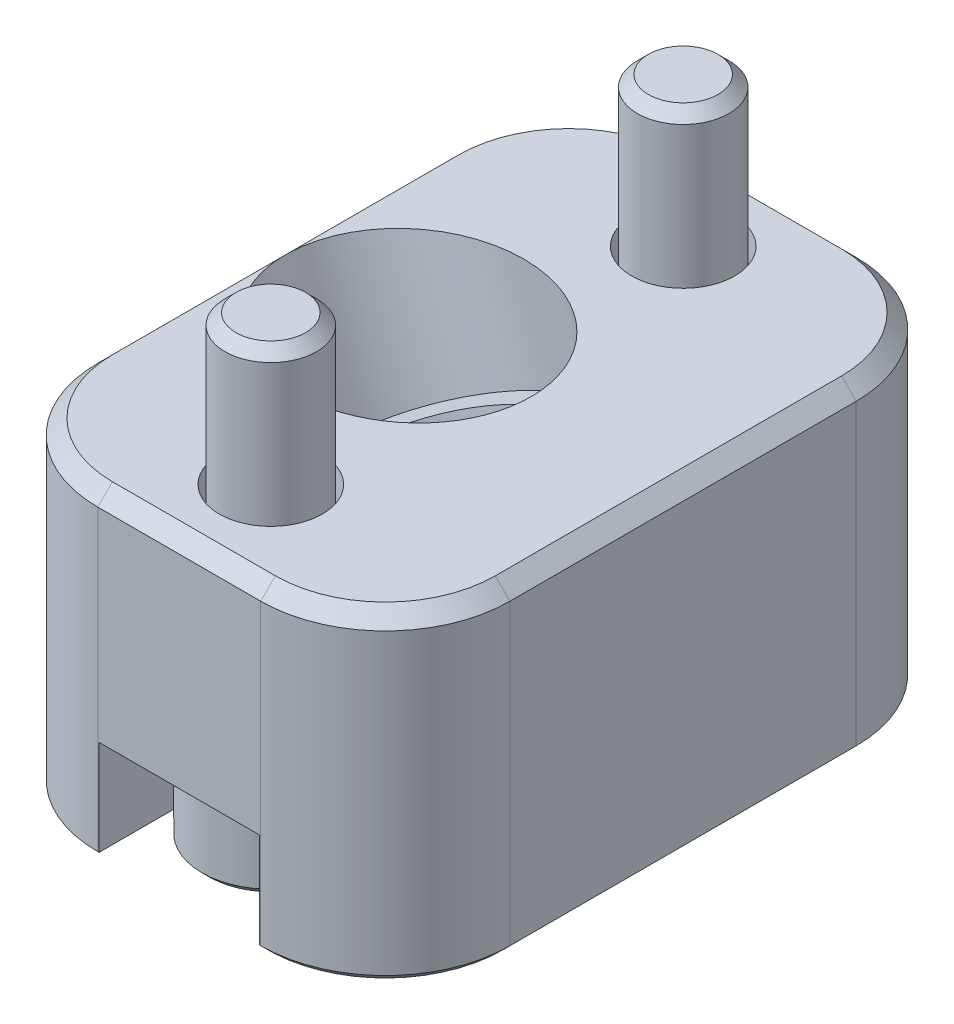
ISO-10303-21;
HEADER;
FILE_DESCRIPTION(('STEP AP214'),'2;1');
FILE_NAME('part.step','',(''),(''),'','','');
FILE_SCHEMA(('AUTOMOTIVE_DESIGN { 1 0 10303 214 1 1 1 1 }'));
ENDSEC;
DATA;
#1=APPLICATION_CONTEXT('core data for automotive mechanical design processes');
#2=APPLICATION_PROTOCOL_DEFINITION('international standard','automotive_design',2000,#1);
#3=PRODUCT_CONTEXT('',#1,'mechanical');
#4=PRODUCT('Part','Part','',(#3));
#5=PRODUCT_RELATED_PRODUCT_CATEGORY('part','',(#4));
#6=PRODUCT_DEFINITION_FORMATION('','',#4);
#7=PRODUCT_DEFINITION_CONTEXT('part definition',#1,'design');
#8=PRODUCT_DEFINITION('design','',#6,#7);
#9=PRODUCT_DEFINITION_SHAPE('','',#8);
#10=(LENGTH_UNIT() NAMED_UNIT(*) SI_UNIT(.MILLI.,.METRE.));
#11=(NAMED_UNIT(*) PLANE_ANGLE_UNIT() SI_UNIT($,.RADIAN.));
#12=(NAMED_UNIT(*) SI_UNIT($,.STERADIAN.) SOLID_ANGLE_UNIT());
#13=UNCERTAINTY_MEASURE_WITH_UNIT(LENGTH_MEASURE(1.E-05),#10,'distance_accuracy_value','');
#14=(GEOMETRIC_REPRESENTATION_CONTEXT(3) GLOBAL_UNCERTAINTY_ASSIGNED_CONTEXT((#13)) GLOBAL_UNIT_ASSIGNED_CONTEXT((#10,
#11,#12)) REPRESENTATION_CONTEXT('',''));
#15=CARTESIAN_POINT('',(0.,0.,0.));
#16=DIRECTION('',(0.,0.,1.));
#17=DIRECTION('',(1.,0.,0.));
#18=AXIS2_PLACEMENT_3D('',#15,#16,#17);
#19=CARTESIAN_POINT('',(4.75615,-21.4376,-19.05));
#20=DIRECTION('',(0.,-1.,0.));
#21=DIRECTION('',(-1.,0.,0.));
#22=AXIS2_PLACEMENT_3D('',#19,#20,#21);
#23=PLANE('',#22);
#24=CARTESIAN_POINT('',(4.75615,-21.4376,-14.2875));
#25=DIRECTION('',(0.,1.,0.));
#26=DIRECTION('',(-1.,0.,0.));
#27=AXIS2_PLACEMENT_3D('',#24,#25,#26);
#28=CIRCLE('',#27,4.25449999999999);
#29=CARTESIAN_POINT('',(0.501650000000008,-21.4376,-14.2875));
#30=VERTEX_POINT('',#29);
#31=EDGE_CURVE('E12',#30,#30,#28,.T.);
#32=ORIENTED_EDGE('',*,*,#31,.F.);
#33=EDGE_LOOP('',(#32));
#34=FACE_BOUND('',#33,.T.);
#35=DIRECTION('',(0.866025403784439,0.,-0.5));
#36=VECTOR('',#35,1.);
#37=CARTESIAN_POINT('',(4.75615,-21.4376,-11.5305369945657));
#38=LINE('',#37,#36);
#39=CARTESIAN_POINT('',(4.75615,-21.4376,-11.5305369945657));
#40=VERTEX_POINT('',#39);
#41=CARTESIAN_POINT('',(7.14375,-21.4376,-12.9090184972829));
#42=VERTEX_POINT('',#41);
#43=EDGE_CURVE('E218',#40,#42,#38,.T.);
#44=ORIENTED_EDGE('',*,*,#43,.T.);
#45=DIRECTION('',(0.,0.,-1.));
#46=VECTOR('',#45,1.);
#47=CARTESIAN_POINT('',(7.14375,-21.4376,-12.9090184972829));
#48=LINE('',#47,#46);
#49=CARTESIAN_POINT('',(7.14375,-21.4376,-15.6659815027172));
#50=VERTEX_POINT('',#49);
#51=EDGE_CURVE('E220',#42,#50,#48,.T.);
#52=ORIENTED_EDGE('',*,*,#51,.T.);
#53=DIRECTION('',(-0.866025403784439,0.,-0.5));
#54=VECTOR('',#53,1.);
#55=CARTESIAN_POINT('',(7.14375,-21.4376,-15.6659815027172));
#56=LINE('',#55,#54);
#57=CARTESIAN_POINT('',(4.75615,-21.4376,-17.0444630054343));
#58=VERTEX_POINT('',#57);
#59=EDGE_CURVE('E222',#50,#58,#56,.T.);
#60=ORIENTED_EDGE('',*,*,#59,.T.);
#61=DIRECTION('',(-0.866025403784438,0.,0.5));
#62=VECTOR('',#61,1.);
#63=CARTESIAN_POINT('',(4.75615,-21.4376,-17.0444630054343));
#64=LINE('',#63,#62);
#65=CARTESIAN_POINT('',(2.36855,-21.4376,-15.6659815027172));
#66=VERTEX_POINT('',#65);
#67=EDGE_CURVE('E228',#58,#66,#64,.T.);
#68=ORIENTED_EDGE('',*,*,#67,.T.);
#69=DIRECTION('',(0.,0.,1.));
#70=VECTOR('',#69,1.);
#71=CARTESIAN_POINT('',(2.36855,-21.4376,-15.6659815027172));
#72=LINE('',#71,#70);
#73=CARTESIAN_POINT('',(2.36855,-21.4376,-12.9090184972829));
#74=VERTEX_POINT('',#73);
#75=EDGE_CURVE('E128',#66,#74,#72,.T.);
#76=ORIENTED_EDGE('',*,*,#75,.T.);
#77=DIRECTION('',(0.866025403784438,0.,0.5));
#78=VECTOR('',#77,1.);
#79=CARTESIAN_POINT('',(2.36855,-21.4376,-12.9090184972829));
#80=LINE('',#79,#78);
#81=EDGE_CURVE('E231',#74,#40,#80,.T.);
#82=ORIENTED_EDGE('',*,*,#81,.T.);
#83=EDGE_LOOP('',(#44,#52,#60,#68,#76,#82));
#84=FACE_BOUND('',#83,.T.);
#85=ADVANCED_FACE('F49',(#34,#84),#23,.T.);
#86=CARTESIAN_POINT('',(4.75615,10.3124,-14.2875));
#87=DIRECTION('',(0.,1.,0.));
#88=DIRECTION('',(1.,0.,0.));
#89=AXIS2_PLACEMENT_3D('',#86,#87,#88);
#90=CYLINDRICAL_SURFACE('',#89,4.7625);
#91=CARTESIAN_POINT('',(4.75615,-20.9296,-14.2875));
#92=DIRECTION('',(0.,1.,0.));
#93=DIRECTION('',(-1.,0.,0.));
#94=AXIS2_PLACEMENT_3D('',#91,#92,#93);
#95=CIRCLE('',#94,4.7625);
#96=CARTESIAN_POINT('',(-0.00634999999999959,-20.9296,-14.2875));
#97=VERTEX_POINT('',#96);
#98=EDGE_CURVE('E57',#97,#97,#95,.F.);
#99=ORIENTED_EDGE('',*,*,#98,.F.);
#100=EDGE_LOOP('',(#99));
#101=FACE_BOUND('',#100,.T.);
#102=CARTESIAN_POINT('',(4.75615,-15.0876,-14.2875));
#103=DIRECTION('',(0.,-1.,0.));
#104=DIRECTION('',(1.,0.,0.));
#105=AXIS2_PLACEMENT_3D('',#102,#103,#104);
#106=CIRCLE('',#105,4.7625);
#107=CARTESIAN_POINT('',(9.51865,-15.0876,-14.2875));
#108=VERTEX_POINT('',#107);
#109=EDGE_CURVE('E142',#108,#108,#106,.T.);
#110=ORIENTED_EDGE('',*,*,#109,.T.);
#111=EDGE_LOOP('',(#110));
#112=FACE_BOUND('',#111,.T.);
#113=ADVANCED_FACE('F154',(#101,#112),#90,.T.);
#114=CARTESIAN_POINT('',(4.75615,-15.0876,-17.4625));
#115=DIRECTION('',(0.,1.,0.));
#116=DIRECTION('',(1.,0.,0.));
#117=AXIS2_PLACEMENT_3D('',#114,#115,#116);
#118=PLANE('',#117);
#119=ORIENTED_EDGE('',*,*,#109,.F.);
#120=EDGE_LOOP('',(#119));
#121=FACE_BOUND('',#120,.T.);
#122=CARTESIAN_POINT('',(4.75615,-15.0876,-14.2875));
#123=DIRECTION('',(0.,-1.,0.));
#124=DIRECTION('',(1.,0.,0.));
#125=AXIS2_PLACEMENT_3D('',#122,#123,#124);
#126=CIRCLE('',#125,3.175);
#127=CARTESIAN_POINT('',(7.93115,-15.0876,-14.2875));
#128=VERTEX_POINT('',#127);
#129=EDGE_CURVE('E139',#128,#128,#126,.T.);
#130=ORIENTED_EDGE('',*,*,#129,.T.);
#131=EDGE_LOOP('',(#130));
#132=FACE_BOUND('',#131,.T.);
#133=ADVANCED_FACE('F157',(#121,#132),#118,.T.);
#134=CARTESIAN_POINT('',(4.75615,10.3124,-14.2875));
#135=DIRECTION('',(0.,1.,0.));
#136=DIRECTION('',(1.,0.,0.));
#137=AXIS2_PLACEMENT_3D('',#134,#135,#136);
#138=CYLINDRICAL_SURFACE('',#137,3.175);
#139=CARTESIAN_POINT('',(4.75615,9.5504,-14.2875));
#140=DIRECTION('',(0.,-1.,0.));
#141=DIRECTION('',(1.,0.,0.));
#142=AXIS2_PLACEMENT_3D('',#139,#140,#141);
#143=CIRCLE('',#142,3.175);
#144=CARTESIAN_POINT('',(7.93115,9.5504,-14.2875));
#145=VERTEX_POINT('',#144);
#146=EDGE_CURVE('E148',#145,#145,#143,.F.);
#147=ORIENTED_EDGE('',*,*,#146,.F.);
#148=EDGE_LOOP('',(#147));
#149=FACE_BOUND('',#148,.T.);
#150=ORIENTED_EDGE('',*,*,#129,.F.);
#151=EDGE_LOOP('',(#150));
#152=FACE_BOUND('',#151,.T.);
#153=ADVANCED_FACE('F163',(#149,#152),#138,.T.);
#154=CARTESIAN_POINT('',(4.75615,10.3124,-14.2875));
#155=DIRECTION('',(0.,1.,0.));
#156=DIRECTION('',(1.,0.,0.));
#157=AXIS2_PLACEMENT_3D('',#154,#155,#156);
#158=PLANE('',#157);
#159=CARTESIAN_POINT('',(4.75615,10.3124,-14.2875));
#160=DIRECTION('',(0.,-1.,0.));
#161=DIRECTION('',(1.,0.,0.));
#162=AXIS2_PLACEMENT_3D('',#159,#160,#161);
#163=CIRCLE('',#162,2.413);
#164=CARTESIAN_POINT('',(7.16915,10.3124,-14.2875));
#165=VERTEX_POINT('',#164);
#166=EDGE_CURVE('E145',#165,#165,#163,.T.);
#167=ORIENTED_EDGE('',*,*,#166,.F.);
#168=EDGE_LOOP('',(#167));
#169=FACE_BOUND('',#168,.T.);
#170=ADVANCED_FACE('F168',(#169),#158,.T.);
#171=CARTESIAN_POINT('',(4.75615,-17.8816,-11.5305369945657));
#172=DIRECTION('',(0.5,0.,0.866025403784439));
#173=DIRECTION('',(-0.866025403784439,0.,0.5));
#174=AXIS2_PLACEMENT_3D('',#171,#172,#173);
#175=PLANE('',#174);
#176=ORIENTED_EDGE('',*,*,#43,.F.);
#177=DIRECTION('',(0.,-1.,0.));
#178=VECTOR('',#177,1.);
#179=CARTESIAN_POINT('',(4.75615,-17.8816,-11.5305369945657));
#180=LINE('',#179,#178);
#181=CARTESIAN_POINT('',(4.75615,-17.8816,-11.5305369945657));
#182=VERTEX_POINT('',#181);
#183=EDGE_CURVE('E95',#182,#40,#180,.T.);
#184=ORIENTED_EDGE('',*,*,#183,.F.);
#185=DIRECTION('',(0.866025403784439,0.,-0.5));
#186=VECTOR('',#185,1.);
#187=CARTESIAN_POINT('',(4.75615,-17.8816,-11.5305369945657));
#188=LINE('',#187,#186);
#189=CARTESIAN_POINT('',(7.14375,-17.8816,-12.9090184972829));
#190=VERTEX_POINT('',#189);
#191=EDGE_CURVE('E232',#182,#190,#188,.T.);
#192=ORIENTED_EDGE('',*,*,#191,.T.);
#193=DIRECTION('',(0.,-1.,0.));
#194=VECTOR('',#193,1.);
#195=CARTESIAN_POINT('',(7.14375,-17.8816,-12.9090184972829));
#196=LINE('',#195,#194);
#197=EDGE_CURVE('E64',#190,#42,#196,.T.);
#198=ORIENTED_EDGE('',*,*,#197,.T.);
#199=EDGE_LOOP('',(#176,#184,#192,#198));
#200=FACE_BOUND('',#199,.T.);
#201=ADVANCED_FACE('F174',(#200),#175,.F.);
#202=CARTESIAN_POINT('',(2.36855,-17.8816,-12.9090184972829));
#203=DIRECTION('',(-0.5,0.,0.866025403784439));
#204=DIRECTION('',(-0.866025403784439,0.,-0.5));
#205=AXIS2_PLACEMENT_3D('',#202,#203,#204);
#206=PLANE('',#205);
#207=ORIENTED_EDGE('',*,*,#81,.F.);
#208=DIRECTION('',(0.,-1.,0.));
#209=VECTOR('',#208,1.);
#210=CARTESIAN_POINT('',(2.36855,-17.8816,-12.9090184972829));
#211=LINE('',#210,#209);
#212=CARTESIAN_POINT('',(2.36855,-17.8816,-12.9090184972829));
#213=VERTEX_POINT('',#212);
#214=EDGE_CURVE('E130',#213,#74,#211,.T.);
#215=ORIENTED_EDGE('',*,*,#214,.F.);
#216=DIRECTION('',(0.866025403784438,0.,0.5));
#217=VECTOR('',#216,1.);
#218=CARTESIAN_POINT('',(2.36855,-17.8816,-12.9090184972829));
#219=LINE('',#218,#217);
#220=EDGE_CURVE('E73',#213,#182,#219,.T.);
#221=ORIENTED_EDGE('',*,*,#220,.T.);
#222=ORIENTED_EDGE('',*,*,#183,.T.);
#223=EDGE_LOOP('',(#207,#215,#221,#222));
#224=FACE_BOUND('',#223,.T.);
#225=ADVANCED_FACE('F204',(#224),#206,.F.);
#226=CARTESIAN_POINT('',(2.36855,-17.8816,-15.6659815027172));
#227=DIRECTION('',(-1.,0.,0.));
#228=DIRECTION('',(0.,1.,0.));
#229=AXIS2_PLACEMENT_3D('',#226,#227,#228);
#230=PLANE('',#229);
#231=ORIENTED_EDGE('',*,*,#75,.F.);
#232=DIRECTION('',(0.,-1.,0.));
#233=VECTOR('',#232,1.);
#234=CARTESIAN_POINT('',(2.36855,-17.8816,-15.6659815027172));
#235=LINE('',#234,#233);
#236=CARTESIAN_POINT('',(2.36855,-17.8816,-15.6659815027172));
#237=VERTEX_POINT('',#236);
#238=EDGE_CURVE('E117',#237,#66,#235,.T.);
#239=ORIENTED_EDGE('',*,*,#238,.F.);
#240=DIRECTION('',(0.,0.,1.));
#241=VECTOR('',#240,1.);
#242=CARTESIAN_POINT('',(2.36855,-17.8816,-15.6659815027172));
#243=LINE('',#242,#241);
#244=EDGE_CURVE('E120',#237,#213,#243,.T.);
#245=ORIENTED_EDGE('',*,*,#244,.T.);
#246=ORIENTED_EDGE('',*,*,#214,.T.);
#247=EDGE_LOOP('',(#231,#239,#245,#246));
#248=FACE_BOUND('',#247,.T.);
#249=ADVANCED_FACE('F126',(#248),#230,.F.);
#250=CARTESIAN_POINT('',(4.75615,-17.8816,-17.0444630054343));
#251=DIRECTION('',(-0.5,0.,-0.866025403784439));
#252=DIRECTION('',(0.866025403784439,0.,-0.5));
#253=AXIS2_PLACEMENT_3D('',#250,#251,#252);
#254=PLANE('',#253);
#255=ORIENTED_EDGE('',*,*,#67,.F.);
#256=DIRECTION('',(0.,-1.,0.));
#257=VECTOR('',#256,1.);
#258=CARTESIAN_POINT('',(4.75615,-17.8816,-17.0444630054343));
#259=LINE('',#258,#257);
#260=CARTESIAN_POINT('',(4.75615,-17.8816,-17.0444630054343));
#261=VERTEX_POINT('',#260);
#262=EDGE_CURVE('E119',#261,#58,#259,.T.);
#263=ORIENTED_EDGE('',*,*,#262,.F.);
#264=DIRECTION('',(-0.866025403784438,0.,0.5));
#265=VECTOR('',#264,1.);
#266=CARTESIAN_POINT('',(4.75615,-17.8816,-17.0444630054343));
#267=LINE('',#266,#265);
#268=EDGE_CURVE('E112',#261,#237,#267,.T.);
#269=ORIENTED_EDGE('',*,*,#268,.T.);
#270=ORIENTED_EDGE('',*,*,#238,.T.);
#271=EDGE_LOOP('',(#255,#263,#269,#270));
#272=FACE_BOUND('',#271,.T.);
#273=ADVANCED_FACE('F115',(#272),#254,.F.);
#274=CARTESIAN_POINT('',(7.14375,-17.8816,-15.6659815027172));
#275=DIRECTION('',(0.5,0.,-0.866025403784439));
#276=DIRECTION('',(0.866025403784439,0.,0.5));
#277=AXIS2_PLACEMENT_3D('',#274,#275,#276);
#278=PLANE('',#277);
#279=ORIENTED_EDGE('',*,*,#59,.F.);
#280=DIRECTION('',(0.,-1.,0.));
#281=VECTOR('',#280,1.);
#282=CARTESIAN_POINT('',(7.14375,-17.8816,-15.6659815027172));
#283=LINE('',#282,#281);
#284=CARTESIAN_POINT('',(7.14375,-17.8816,-15.6659815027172));
#285=VERTEX_POINT('',#284);
#286=EDGE_CURVE('E133',#285,#50,#283,.T.);
#287=ORIENTED_EDGE('',*,*,#286,.F.);
#288=DIRECTION('',(-0.866025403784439,0.,-0.5));
#289=VECTOR('',#288,1.);
#290=CARTESIAN_POINT('',(7.14375,-17.8816,-15.6659815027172));
#291=LINE('',#290,#289);
#292=EDGE_CURVE('E121',#285,#261,#291,.T.);
#293=ORIENTED_EDGE('',*,*,#292,.T.);
#294=ORIENTED_EDGE('',*,*,#262,.T.);
#295=EDGE_LOOP('',(#279,#287,#293,#294));
#296=FACE_BOUND('',#295,.T.);
#297=ADVANCED_FACE('F200',(#296),#278,.F.);
#298=CARTESIAN_POINT('',(7.14375,-17.8816,-12.9090184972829));
#299=DIRECTION('',(1.,0.,0.));
#300=DIRECTION('',(0.,-1.,0.));
#301=AXIS2_PLACEMENT_3D('',#298,#299,#300);
#302=PLANE('',#301);
#303=ORIENTED_EDGE('',*,*,#51,.F.);
#304=ORIENTED_EDGE('',*,*,#197,.F.);
#305=DIRECTION('',(0.,0.,-1.));
#306=VECTOR('',#305,1.);
#307=CARTESIAN_POINT('',(7.14375,-17.8816,-12.9090184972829));
#308=LINE('',#307,#306);
#309=EDGE_CURVE('E103',#190,#285,#308,.T.);
#310=ORIENTED_EDGE('',*,*,#309,.T.);
#311=ORIENTED_EDGE('',*,*,#286,.T.);
#312=EDGE_LOOP('',(#303,#304,#310,#311));
#313=FACE_BOUND('',#312,.T.);
#314=ADVANCED_FACE('F193',(#313),#302,.F.);
#315=CARTESIAN_POINT('',(4.75615,-17.8816,-11.5305369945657));
#316=DIRECTION('',(0.,1.,0.));
#317=DIRECTION('',(1.,0.,0.));
#318=AXIS2_PLACEMENT_3D('',#315,#316,#317);
#319=PLANE('',#318);
#320=ORIENTED_EDGE('',*,*,#191,.F.);
#321=ORIENTED_EDGE('',*,*,#220,.F.);
#322=ORIENTED_EDGE('',*,*,#244,.F.);
#323=ORIENTED_EDGE('',*,*,#268,.F.);
#324=ORIENTED_EDGE('',*,*,#292,.F.);
#325=ORIENTED_EDGE('',*,*,#309,.F.);
#326=EDGE_LOOP('',(#320,#321,#322,#323,#324,#325));
#327=FACE_BOUND('',#326,.T.);
#328=ADVANCED_FACE('F123',(#327),#319,.F.);
#329=CARTESIAN_POINT('',(4.75615,10.3124,-14.2875));
#330=DIRECTION('',(0.,-1.,0.));
#331=DIRECTION('',(-1.,0.,0.));
#332=AXIS2_PLACEMENT_3D('',#329,#330,#331);
#333=CONICAL_SURFACE('',#332,2.413,0.785398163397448);
#334=ORIENTED_EDGE('',*,*,#146,.T.);
#335=EDGE_LOOP('',(#334));
#336=FACE_BOUND('',#335,.T.);
#337=ORIENTED_EDGE('',*,*,#166,.T.);
#338=EDGE_LOOP('',(#337));
#339=FACE_BOUND('',#338,.T.);
#340=ADVANCED_FACE('F185',(#336,#339),#333,.T.);
#341=CARTESIAN_POINT('',(4.75615,-20.9296,-14.2875));
#342=DIRECTION('',(0.,1.,0.));
#343=DIRECTION('',(1.,0.,0.));
#344=AXIS2_PLACEMENT_3D('',#341,#342,#343);
#345=CONICAL_SURFACE('',#344,4.7625,0.785398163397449);
#346=ORIENTED_EDGE('',*,*,#31,.T.);
#347=EDGE_LOOP('',(#346));
#348=FACE_BOUND('',#347,.T.);
#349=ORIENTED_EDGE('',*,*,#98,.T.);
#350=EDGE_LOOP('',(#349));
#351=FACE_BOUND('',#350,.T.);
#352=ADVANCED_FACE('F51',(#348,#351),#345,.T.);
#353=CLOSED_SHELL('',(#85,#113,#133,#153,#170,#201,#225,#249,#273,#297,#314,#328,#340,#352));
#354=MANIFOLD_SOLID_BREP('B2',#353);
#355=CARTESIAN_POINT('',(4.75615,-21.4376,19.05));
#356=DIRECTION('',(0.,-1.,0.));
#357=DIRECTION('',(-1.,0.,0.));
#358=AXIS2_PLACEMENT_3D('',#355,#356,#357);
#359=PLANE('',#358);
#360=CARTESIAN_POINT('',(4.75615,-21.4376,14.2875));
#361=DIRECTION('',(0.,-1.,0.));
#362=DIRECTION('',(-1.,0.,0.));
#363=AXIS2_PLACEMENT_3D('',#360,#361,#362);
#364=CIRCLE('',#363,4.25449999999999);
#365=CARTESIAN_POINT('',(0.501650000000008,-21.4376,14.2875));
#366=VERTEX_POINT('',#365);
#367=EDGE_CURVE('E47',#366,#366,#364,.T.);
#368=ORIENTED_EDGE('',*,*,#367,.T.);
#369=EDGE_LOOP('',(#368));
#370=FACE_BOUND('',#369,.T.);
#371=DIRECTION('',(0.866025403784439,0.,0.5));
#372=VECTOR('',#371,1.);
#373=CARTESIAN_POINT('',(4.75615,-21.4376,11.5305369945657));
#374=LINE('',#373,#372);
#375=CARTESIAN_POINT('',(4.75615,-21.4376,11.5305369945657));
#376=VERTEX_POINT('',#375);
#377=CARTESIAN_POINT('',(7.14375,-21.4376,12.9090184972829));
#378=VERTEX_POINT('',#377);
#379=EDGE_CURVE('E338',#376,#378,#374,.T.);
#380=ORIENTED_EDGE('',*,*,#379,.F.);
#381=DIRECTION('',(0.866025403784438,0.,-0.5));
#382=VECTOR('',#381,1.);
#383=CARTESIAN_POINT('',(2.36855,-21.4376,12.9090184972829));
#384=LINE('',#383,#382);
#385=CARTESIAN_POINT('',(2.36855,-21.4376,12.9090184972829));
#386=VERTEX_POINT('',#385);
#387=EDGE_CURVE('E421',#386,#376,#384,.T.);
#388=ORIENTED_EDGE('',*,*,#387,.F.);
#389=DIRECTION('',(0.,0.,-1.));
#390=VECTOR('',#389,1.);
#391=CARTESIAN_POINT('',(2.36855,-21.4376,15.6659815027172));
#392=LINE('',#391,#390);
#393=CARTESIAN_POINT('',(2.36855,-21.4376,15.6659815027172));
#394=VERTEX_POINT('',#393);
#395=EDGE_CURVE('E419',#394,#386,#392,.T.);
#396=ORIENTED_EDGE('',*,*,#395,.F.);
#397=DIRECTION('',(-0.866025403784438,0.,-0.5));
#398=VECTOR('',#397,1.);
#399=CARTESIAN_POINT('',(4.75615,-21.4376,17.0444630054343));
#400=LINE('',#399,#398);
#401=CARTESIAN_POINT('',(4.75615,-21.4376,17.0444630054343));
#402=VERTEX_POINT('',#401);
#403=EDGE_CURVE('E386',#402,#394,#400,.T.);
#404=ORIENTED_EDGE('',*,*,#403,.F.);
#405=DIRECTION('',(-0.866025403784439,0.,0.5));
#406=VECTOR('',#405,1.);
#407=CARTESIAN_POINT('',(7.14375,-21.4376,15.6659815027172));
#408=LINE('',#407,#406);
#409=CARTESIAN_POINT('',(7.14375,-21.4376,15.6659815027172));
#410=VERTEX_POINT('',#409);
#411=EDGE_CURVE('E415',#410,#402,#408,.T.);
#412=ORIENTED_EDGE('',*,*,#411,.F.);
#413=DIRECTION('',(0.,0.,1.));
#414=VECTOR('',#413,1.);
#415=CARTESIAN_POINT('',(7.14375,-21.4376,12.9090184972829));
#416=LINE('',#415,#414);
#417=EDGE_CURVE('E412',#378,#410,#416,.T.);
#418=ORIENTED_EDGE('',*,*,#417,.F.);
#419=EDGE_LOOP('',(#380,#388,#396,#404,#412,#418));
#420=FACE_BOUND('',#419,.T.);
#421=ADVANCED_FACE('F323',(#370,#420),#359,.T.);
#422=CARTESIAN_POINT('',(4.75615,10.3124,14.2875));
#423=DIRECTION('',(0.,1.,0.));
#424=DIRECTION('',(1.,0.,0.));
#425=AXIS2_PLACEMENT_3D('',#422,#423,#424);
#426=CYLINDRICAL_SURFACE('',#425,4.7625);
#427=CARTESIAN_POINT('',(4.75615,-20.9296,14.2875));
#428=DIRECTION('',(0.,-1.,0.));
#429=DIRECTION('',(-1.,0.,0.));
#430=AXIS2_PLACEMENT_3D('',#427,#428,#429);
#431=CIRCLE('',#430,4.7625);
#432=CARTESIAN_POINT('',(-0.00634999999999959,-20.9296,14.2875));
#433=VERTEX_POINT('',#432);
#434=EDGE_CURVE('E331',#433,#433,#431,.F.);
#435=ORIENTED_EDGE('',*,*,#434,.T.);
#436=EDGE_LOOP('',(#435));
#437=FACE_BOUND('',#436,.T.);
#438=CARTESIAN_POINT('',(4.75615,-15.0876,14.2875));
#439=DIRECTION('',(0.,1.,0.));
#440=DIRECTION('',(1.,0.,0.));
#441=AXIS2_PLACEMENT_3D('',#438,#439,#440);
#442=CIRCLE('',#441,4.7625);
#443=CARTESIAN_POINT('',(9.51865,-15.0876,14.2875));
#444=VERTEX_POINT('',#443);
#445=EDGE_CURVE('E433',#444,#444,#442,.T.);
#446=ORIENTED_EDGE('',*,*,#445,.F.);
#447=EDGE_LOOP('',(#446));
#448=FACE_BOUND('',#447,.T.);
#449=ADVANCED_FACE('F444',(#437,#448),#426,.T.);
#450=CARTESIAN_POINT('',(4.75615,-15.0876,17.4625));
#451=DIRECTION('',(0.,1.,0.));
#452=DIRECTION('',(1.,0.,0.));
#453=AXIS2_PLACEMENT_3D('',#450,#451,#452);
#454=PLANE('',#453);
#455=ORIENTED_EDGE('',*,*,#445,.T.);
#456=EDGE_LOOP('',(#455));
#457=FACE_BOUND('',#456,.T.);
#458=CARTESIAN_POINT('',(4.75615,-15.0876,14.2875));
#459=DIRECTION('',(0.,1.,0.));
#460=DIRECTION('',(1.,0.,0.));
#461=AXIS2_PLACEMENT_3D('',#458,#459,#460);
#462=CIRCLE('',#461,3.175);
#463=CARTESIAN_POINT('',(7.93115,-15.0876,14.2875));
#464=VERTEX_POINT('',#463);
#465=EDGE_CURVE('E425',#464,#464,#462,.T.);
#466=ORIENTED_EDGE('',*,*,#465,.F.);
#467=EDGE_LOOP('',(#466));
#468=FACE_BOUND('',#467,.T.);
#469=ADVANCED_FACE('F461',(#457,#468),#454,.T.);
#470=CARTESIAN_POINT('',(4.75615,10.3124,14.2875));
#471=DIRECTION('',(0.,1.,0.));
#472=DIRECTION('',(1.,0.,0.));
#473=AXIS2_PLACEMENT_3D('',#470,#471,#472);
#474=CYLINDRICAL_SURFACE('',#473,3.175);
#475=CARTESIAN_POINT('',(4.75615,9.5504,14.2875));
#476=DIRECTION('',(0.,1.,0.));
#477=DIRECTION('',(1.,0.,0.));
#478=AXIS2_PLACEMENT_3D('',#475,#476,#477);
#479=CIRCLE('',#478,3.175);
#480=CARTESIAN_POINT('',(7.93115,9.5504,14.2875));
#481=VERTEX_POINT('',#480);
#482=EDGE_CURVE('E439',#481,#481,#479,.F.);
#483=ORIENTED_EDGE('',*,*,#482,.T.);
#484=EDGE_LOOP('',(#483));
#485=FACE_BOUND('',#484,.T.);
#486=ORIENTED_EDGE('',*,*,#465,.T.);
#487=EDGE_LOOP('',(#486));
#488=FACE_BOUND('',#487,.T.);
#489=ADVANCED_FACE('F467',(#485,#488),#474,.T.);
#490=CARTESIAN_POINT('',(4.75615,10.3124,14.2875));
#491=DIRECTION('',(0.,1.,0.));
#492=DIRECTION('',(1.,0.,0.));
#493=AXIS2_PLACEMENT_3D('',#490,#491,#492);
#494=PLANE('',#493);
#495=CARTESIAN_POINT('',(4.75615,10.3124,14.2875));
#496=DIRECTION('',(0.,1.,0.));
#497=DIRECTION('',(1.,0.,0.));
#498=AXIS2_PLACEMENT_3D('',#495,#496,#497);
#499=CIRCLE('',#498,2.413);
#500=CARTESIAN_POINT('',(7.16915,10.3124,14.2875));
#501=VERTEX_POINT('',#500);
#502=EDGE_CURVE('E436',#501,#501,#499,.T.);
#503=ORIENTED_EDGE('',*,*,#502,.T.);
#504=EDGE_LOOP('',(#503));
#505=FACE_BOUND('',#504,.T.);
#506=ADVANCED_FACE('F471',(#505),#494,.T.);
#507=CARTESIAN_POINT('',(4.75615,-17.8816,11.5305369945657));
#508=DIRECTION('',(0.5,0.,-0.866025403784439));
#509=DIRECTION('',(-0.866025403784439,0.,-0.5));
#510=AXIS2_PLACEMENT_3D('',#507,#508,#509);
#511=PLANE('',#510);
#512=ORIENTED_EDGE('',*,*,#379,.T.);
#513=DIRECTION('',(0.,-1.,0.));
#514=VECTOR('',#513,1.);
#515=CARTESIAN_POINT('',(7.14375,-17.8816,12.9090184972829));
#516=LINE('',#515,#514);
#517=CARTESIAN_POINT('',(7.14375,-17.8816,12.9090184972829));
#518=VERTEX_POINT('',#517);
#519=EDGE_CURVE('E368',#518,#378,#516,.T.);
#520=ORIENTED_EDGE('',*,*,#519,.F.);
#521=DIRECTION('',(0.866025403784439,0.,0.5));
#522=VECTOR('',#521,1.);
#523=CARTESIAN_POINT('',(4.75615,-17.8816,11.5305369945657));
#524=LINE('',#523,#522);
#525=CARTESIAN_POINT('',(4.75615,-17.8816,11.5305369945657));
#526=VERTEX_POINT('',#525);
#527=EDGE_CURVE('E423',#526,#518,#524,.T.);
#528=ORIENTED_EDGE('',*,*,#527,.F.);
#529=DIRECTION('',(0.,-1.,0.));
#530=VECTOR('',#529,1.);
#531=CARTESIAN_POINT('',(4.75615,-17.8816,11.5305369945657));
#532=LINE('',#531,#530);
#533=EDGE_CURVE('E346',#526,#376,#532,.T.);
#534=ORIENTED_EDGE('',*,*,#533,.T.);
#535=EDGE_LOOP('',(#512,#520,#528,#534));
#536=FACE_BOUND('',#535,.T.);
#537=ADVANCED_FACE('F475',(#536),#511,.F.);
#538=CARTESIAN_POINT('',(2.36855,-17.8816,12.9090184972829));
#539=DIRECTION('',(-0.5,0.,-0.866025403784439));
#540=DIRECTION('',(-0.866025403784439,0.,0.5));
#541=AXIS2_PLACEMENT_3D('',#538,#539,#540);
#542=PLANE('',#541);
#543=ORIENTED_EDGE('',*,*,#387,.T.);
#544=ORIENTED_EDGE('',*,*,#533,.F.);
#545=DIRECTION('',(0.866025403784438,0.,-0.5));
#546=VECTOR('',#545,1.);
#547=CARTESIAN_POINT('',(2.36855,-17.8816,12.9090184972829));
#548=LINE('',#547,#546);
#549=CARTESIAN_POINT('',(2.36855,-17.8816,12.9090184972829));
#550=VERTEX_POINT('',#549);
#551=EDGE_CURVE('E398',#550,#526,#548,.T.);
#552=ORIENTED_EDGE('',*,*,#551,.F.);
#553=DIRECTION('',(0.,-1.,0.));
#554=VECTOR('',#553,1.);
#555=CARTESIAN_POINT('',(2.36855,-17.8816,12.9090184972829));
#556=LINE('',#555,#554);
#557=EDGE_CURVE('E390',#550,#386,#556,.T.);
#558=ORIENTED_EDGE('',*,*,#557,.T.);
#559=EDGE_LOOP('',(#543,#544,#552,#558));
#560=FACE_BOUND('',#559,.T.);
#561=ADVANCED_FACE('F479',(#560),#542,.F.);
#562=CARTESIAN_POINT('',(2.36855,-17.8816,15.6659815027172));
#563=DIRECTION('',(-1.,0.,0.));
#564=DIRECTION('',(0.,1.,0.));
#565=AXIS2_PLACEMENT_3D('',#562,#563,#564);
#566=PLANE('',#565);
#567=ORIENTED_EDGE('',*,*,#395,.T.);
#568=ORIENTED_EDGE('',*,*,#557,.F.);
#569=DIRECTION('',(0.,0.,-1.));
#570=VECTOR('',#569,1.);
#571=CARTESIAN_POINT('',(2.36855,-17.8816,15.6659815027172));
#572=LINE('',#571,#570);
#573=CARTESIAN_POINT('',(2.36855,-17.8816,15.6659815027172));
#574=VERTEX_POINT('',#573);
#575=EDGE_CURVE('E394',#574,#550,#572,.T.);
#576=ORIENTED_EDGE('',*,*,#575,.F.);
#577=DIRECTION('',(0.,-1.,0.));
#578=VECTOR('',#577,1.);
#579=CARTESIAN_POINT('',(2.36855,-17.8816,15.6659815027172));
#580=LINE('',#579,#578);
#581=EDGE_CURVE('E379',#574,#394,#580,.T.);
#582=ORIENTED_EDGE('',*,*,#581,.T.);
#583=EDGE_LOOP('',(#567,#568,#576,#582));
#584=FACE_BOUND('',#583,.T.);
#585=ADVANCED_FACE('F395',(#584),#566,.F.);
#586=CARTESIAN_POINT('',(4.75615,-17.8816,17.0444630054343));
#587=DIRECTION('',(-0.5,0.,0.866025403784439));
#588=DIRECTION('',(0.866025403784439,0.,0.5));
#589=AXIS2_PLACEMENT_3D('',#586,#587,#588);
#590=PLANE('',#589);
#591=ORIENTED_EDGE('',*,*,#403,.T.);
#592=ORIENTED_EDGE('',*,*,#581,.F.);
#593=DIRECTION('',(-0.866025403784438,0.,-0.5));
#594=VECTOR('',#593,1.);
#595=CARTESIAN_POINT('',(4.75615,-17.8816,17.0444630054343));
#596=LINE('',#595,#594);
#597=CARTESIAN_POINT('',(4.75615,-17.8816,17.0444630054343));
#598=VERTEX_POINT('',#597);
#599=EDGE_CURVE('E383',#598,#574,#596,.T.);
#600=ORIENTED_EDGE('',*,*,#599,.F.);
#601=DIRECTION('',(0.,-1.,0.));
#602=VECTOR('',#601,1.);
#603=CARTESIAN_POINT('',(4.75615,-17.8816,17.0444630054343));
#604=LINE('',#603,#602);
#605=EDGE_CURVE('E391',#598,#402,#604,.T.);
#606=ORIENTED_EDGE('',*,*,#605,.T.);
#607=EDGE_LOOP('',(#591,#592,#600,#606));
#608=FACE_BOUND('',#607,.T.);
#609=ADVANCED_FACE('F381',(#608),#590,.F.);
#610=CARTESIAN_POINT('',(7.14375,-17.8816,15.6659815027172));
#611=DIRECTION('',(0.5,0.,0.866025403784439));
#612=DIRECTION('',(0.866025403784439,0.,-0.5));
#613=AXIS2_PLACEMENT_3D('',#610,#611,#612);
#614=PLANE('',#613);
#615=ORIENTED_EDGE('',*,*,#411,.T.);
#616=ORIENTED_EDGE('',*,*,#605,.F.);
#617=DIRECTION('',(-0.866025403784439,0.,0.5));
#618=VECTOR('',#617,1.);
#619=CARTESIAN_POINT('',(7.14375,-17.8816,15.6659815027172));
#620=LINE('',#619,#618);
#621=CARTESIAN_POINT('',(7.14375,-17.8816,15.6659815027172));
#622=VERTEX_POINT('',#621);
#623=EDGE_CURVE('E404',#622,#598,#620,.T.);
#624=ORIENTED_EDGE('',*,*,#623,.F.);
#625=DIRECTION('',(0.,-1.,0.));
#626=VECTOR('',#625,1.);
#627=CARTESIAN_POINT('',(7.14375,-17.8816,15.6659815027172));
#628=LINE('',#627,#626);
#629=EDGE_CURVE('E428',#622,#410,#628,.T.);
#630=ORIENTED_EDGE('',*,*,#629,.T.);
#631=EDGE_LOOP('',(#615,#616,#624,#630));
#632=FACE_BOUND('',#631,.T.);
#633=ADVANCED_FACE('F483',(#632),#614,.F.);
#634=CARTESIAN_POINT('',(7.14375,-17.8816,12.9090184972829));
#635=DIRECTION('',(1.,0.,0.));
#636=DIRECTION('',(0.,-1.,0.));
#637=AXIS2_PLACEMENT_3D('',#634,#635,#636);
#638=PLANE('',#637);
#639=ORIENTED_EDGE('',*,*,#417,.T.);
#640=ORIENTED_EDGE('',*,*,#629,.F.);
#641=DIRECTION('',(0.,0.,1.));
#642=VECTOR('',#641,1.);
#643=CARTESIAN_POINT('',(7.14375,-17.8816,12.9090184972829));
#644=LINE('',#643,#642);
#645=EDGE_CURVE('E406',#518,#622,#644,.T.);
#646=ORIENTED_EDGE('',*,*,#645,.F.);
#647=ORIENTED_EDGE('',*,*,#519,.T.);
#648=EDGE_LOOP('',(#639,#640,#646,#647));
#649=FACE_BOUND('',#648,.T.);
#650=ADVANCED_FACE('F480',(#649),#638,.F.);
#651=CARTESIAN_POINT('',(4.75615,-17.8816,11.5305369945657));
#652=DIRECTION('',(0.,1.,0.));
#653=DIRECTION('',(1.,0.,0.));
#654=AXIS2_PLACEMENT_3D('',#651,#652,#653);
#655=PLANE('',#654);
#656=ORIENTED_EDGE('',*,*,#527,.T.);
#657=ORIENTED_EDGE('',*,*,#645,.T.);
#658=ORIENTED_EDGE('',*,*,#623,.T.);
#659=ORIENTED_EDGE('',*,*,#599,.T.);
#660=ORIENTED_EDGE('',*,*,#575,.T.);
#661=ORIENTED_EDGE('',*,*,#551,.T.);
#662=EDGE_LOOP('',(#656,#657,#658,#659,#660,#661));
#663=FACE_BOUND('',#662,.T.);
#664=ADVANCED_FACE('F401',(#663),#655,.F.);
#665=CARTESIAN_POINT('',(4.75615,10.3124,14.2875));
#666=DIRECTION('',(0.,-1.,0.));
#667=DIRECTION('',(-1.,0.,0.));
#668=AXIS2_PLACEMENT_3D('',#665,#666,#667);
#669=CONICAL_SURFACE('',#668,2.413,0.785398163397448);
#670=ORIENTED_EDGE('',*,*,#482,.F.);
#671=EDGE_LOOP('',(#670));
#672=FACE_BOUND('',#671,.T.);
#673=ORIENTED_EDGE('',*,*,#502,.F.);
#674=EDGE_LOOP('',(#673));
#675=FACE_BOUND('',#674,.T.);
#676=ADVANCED_FACE('F448',(#672,#675),#669,.T.);
#677=CARTESIAN_POINT('',(4.75615,-20.9296,14.2875));
#678=DIRECTION('',(0.,1.,0.));
#679=DIRECTION('',(1.,0.,0.));
#680=AXIS2_PLACEMENT_3D('',#677,#678,#679);
#681=CONICAL_SURFACE('',#680,4.7625,0.785398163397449);
#682=ORIENTED_EDGE('',*,*,#367,.F.);
#683=EDGE_LOOP('',(#682));
#684=FACE_BOUND('',#683,.T.);
#685=ORIENTED_EDGE('',*,*,#434,.F.);
#686=EDGE_LOOP('',(#685));
#687=FACE_BOUND('',#686,.T.);
#688=ADVANCED_FACE('F325',(#684,#687),#681,.T.);
#689=CLOSED_SHELL('',(#421,#449,#469,#489,#506,#537,#561,#585,#609,#633,#650,#664,#676,#688));
#690=MANIFOLD_SOLID_BREP('B6',#689);
#691=CARTESIAN_POINT('',(10.4013,0.,-11.99515));
#692=DIRECTION('',(0.,-1.,0.));
#693=DIRECTION('',(0.,0.,-1.));
#694=AXIS2_PLACEMENT_3D('',#691,#692,#693);
#695=CYLINDRICAL_SURFACE('',#694,8.636);
#696=DIRECTION('',(0.,-1.,0.));
#697=VECTOR('',#696,1.);
#698=CARTESIAN_POINT('',(19.0373,0.,-11.99515));
#699=LINE('',#698,#697);
#700=CARTESIAN_POINT('',(19.0373,-1.016,-11.99515));
#701=VERTEX_POINT('',#700);
#702=CARTESIAN_POINT('',(19.0373,-21.6916,-11.99515));
#703=VERTEX_POINT('',#702);
#704=EDGE_CURVE('E838',#701,#703,#699,.T.);
#705=ORIENTED_EDGE('',*,*,#704,.T.);
#706=CARTESIAN_POINT('',(10.4013,-21.6916,-11.99515));
#707=DIRECTION('',(0.,-1.,0.));
#708=DIRECTION('',(0.,0.,-1.));
#709=AXIS2_PLACEMENT_3D('',#706,#707,#708);
#710=CIRCLE('',#709,8.636);
#711=CARTESIAN_POINT('',(10.4013,-21.6916,-20.63115));
#712=VERTEX_POINT('',#711);
#713=EDGE_CURVE('E1113',#703,#712,#710,.F.);
#714=ORIENTED_EDGE('',*,*,#713,.T.);
#715=DIRECTION('',(0.,-1.,0.));
#716=VECTOR('',#715,1.);
#717=CARTESIAN_POINT('',(10.4013,0.,-20.63115));
#718=LINE('',#717,#716);
#719=CARTESIAN_POINT('',(10.4013,-1.016,-20.63115));
#720=VERTEX_POINT('',#719);
#721=EDGE_CURVE('E857',#720,#712,#718,.T.);
#722=ORIENTED_EDGE('',*,*,#721,.F.);
#723=CARTESIAN_POINT('',(10.4013,-1.016,-11.99515));
#724=DIRECTION('',(0.,-1.,0.));
#725=DIRECTION('',(0.,0.,-1.));
#726=AXIS2_PLACEMENT_3D('',#723,#724,#725);
#727=CIRCLE('',#726,8.636);
#728=EDGE_CURVE('E888',#720,#701,#727,.T.);
#729=ORIENTED_EDGE('',*,*,#728,.T.);
#730=EDGE_LOOP('',(#705,#714,#722,#729));
#731=FACE_BOUND('',#730,.T.);
#732=ADVANCED_FACE('F561',(#731),#695,.T.);
#733=CARTESIAN_POINT('',(10.4013,0.,-20.63115));
#734=DIRECTION('',(0.,0.,1.));
#735=DIRECTION('',(1.,0.,0.));
#736=AXIS2_PLACEMENT_3D('',#733,#734,#735);
#737=PLANE('',#736);
#738=DIRECTION('',(0.,-1.,0.));
#739=VECTOR('',#738,1.);
#740=CARTESIAN_POINT('',(-0.800099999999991,1.19414672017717,-20.63115));
#741=LINE('',#740,#739);
#742=CARTESIAN_POINT('',(-0.800099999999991,-15.0876,-20.63115));
#743=VERTEX_POINT('',#742);
#744=CARTESIAN_POINT('',(-0.800099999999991,-21.6911424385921,-20.63115));
#745=VERTEX_POINT('',#744);
#746=EDGE_CURVE('E796',#743,#745,#741,.T.);
#747=ORIENTED_EDGE('',*,*,#746,.T.);
#748=CARTESIAN_POINT('',(-0.800099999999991,-21.6911424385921,-20.63115));
#749=CARTESIAN_POINT('',(-0.814916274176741,-21.6912949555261,-20.63115));
#750=CARTESIAN_POINT('',(-0.82973274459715,-21.6914093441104,-20.63115));
#751=CARTESIAN_POINT('',(-0.859366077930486,-21.6915618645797,-20.63115));
#752=CARTESIAN_POINT('',(-0.874182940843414,-21.6915999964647,-20.63115));
#753=CARTESIAN_POINT('',(-0.889000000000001,-21.6916,-20.63115));
#754=B_SPLINE_CURVE_WITH_KNOTS('',3,(#748,#749,#750,#751,#752,#753),.UNSPECIFIED.,.F.,.F.,(4,2,
4),(0.,0.0444507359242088,0.0889014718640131),.UNSPECIFIED.);
#755=CARTESIAN_POINT('',(-0.889000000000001,-21.6916,-20.63115));
#756=VERTEX_POINT('',#755);
#757=EDGE_CURVE('E1008',#745,#756,#754,.T.);
#758=ORIENTED_EDGE('',*,*,#757,.T.);
#759=DIRECTION('',(0.,-1.,0.));
#760=VECTOR('',#759,1.);
#761=CARTESIAN_POINT('',(-0.889000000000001,0.,-20.63115));
#762=LINE('',#761,#760);
#763=CARTESIAN_POINT('',(-0.889000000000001,-1.016,-20.63115));
#764=VERTEX_POINT('',#763);
#765=EDGE_CURVE('E854',#764,#756,#762,.T.);
#766=ORIENTED_EDGE('',*,*,#765,.F.);
#767=DIRECTION('',(1.,0.,0.));
#768=VECTOR('',#767,1.);
#769=CARTESIAN_POINT('',(10.4013,-1.016,-20.63115));
#770=LINE('',#769,#768);
#771=EDGE_CURVE('E883',#764,#720,#770,.T.);
#772=ORIENTED_EDGE('',*,*,#771,.T.);
#773=ORIENTED_EDGE('',*,*,#721,.T.);
#774=CARTESIAN_POINT('',(10.4013,-21.6916,-20.63115));
#775=CARTESIAN_POINT('',(10.3864829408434,-21.6915999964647,-20.63115));
#776=CARTESIAN_POINT('',(10.3716660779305,-21.6915618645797,-20.63115));
#777=CARTESIAN_POINT('',(10.3420327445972,-21.6914093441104,-20.63115));
#778=CARTESIAN_POINT('',(10.3272162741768,-21.6912949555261,-20.63115));
#779=CARTESIAN_POINT('',(10.3124,-21.6911424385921,-20.63115));
#780=B_SPLINE_CURVE_WITH_KNOTS('',3,(#774,#775,#776,#777,#778,#779),.UNSPECIFIED.,.F.,.F.,(4,2,
4),(0.,0.0444507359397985,0.0889014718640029),.UNSPECIFIED.);
#781=CARTESIAN_POINT('',(10.3124,-21.6911424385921,-20.63115));
#782=VERTEX_POINT('',#781);
#783=EDGE_CURVE('E1016',#712,#782,#780,.T.);
#784=ORIENTED_EDGE('',*,*,#783,.T.);
#785=DIRECTION('',(0.,-1.,0.));
#786=VECTOR('',#785,1.);
#787=CARTESIAN_POINT('',(10.3124,1.19414672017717,-20.63115));
#788=LINE('',#787,#786);
#789=CARTESIAN_POINT('',(10.3124,-15.0876,-20.63115));
#790=VERTEX_POINT('',#789);
#791=EDGE_CURVE('E802',#790,#782,#788,.T.);
#792=ORIENTED_EDGE('',*,*,#791,.F.);
#793=DIRECTION('',(1.,0.,0.));
#794=VECTOR('',#793,1.);
#795=CARTESIAN_POINT('',(10.3124,-15.0876,-20.63115));
#796=LINE('',#795,#794);
#797=EDGE_CURVE('E803',#743,#790,#796,.T.);
#798=ORIENTED_EDGE('',*,*,#797,.F.);
#799=EDGE_LOOP('',(#747,#758,#766,#772,#773,#784,#792,#798));
#800=FACE_BOUND('',#799,.T.);
#801=ADVANCED_FACE('F1023',(#800),#737,.F.);
#802=CARTESIAN_POINT('',(-0.889,0.,-11.99515));
#803=DIRECTION('',(0.,-1.,0.));
#804=DIRECTION('',(0.,0.,-1.));
#805=AXIS2_PLACEMENT_3D('',#802,#803,#804);
#806=CYLINDRICAL_SURFACE('',#805,8.636);
#807=ORIENTED_EDGE('',*,*,#765,.T.);
#808=CARTESIAN_POINT('',(-0.889,-21.6916,-11.99515));
#809=DIRECTION('',(0.,-1.,0.));
#810=DIRECTION('',(0.,0.,-1.));
#811=AXIS2_PLACEMENT_3D('',#808,#809,#810);
#812=CIRCLE('',#811,8.636);
#813=CARTESIAN_POINT('',(-9.525,-21.6916,-11.99515));
#814=VERTEX_POINT('',#813);
#815=EDGE_CURVE('E949',#756,#814,#812,.F.);
#816=ORIENTED_EDGE('',*,*,#815,.T.);
#817=DIRECTION('',(0.,-1.,0.));
#818=VECTOR('',#817,1.);
#819=CARTESIAN_POINT('',(-9.525,0.,-11.99515));
#820=LINE('',#819,#818);
#821=CARTESIAN_POINT('',(-9.525,-1.016,-11.99515));
#822=VERTEX_POINT('',#821);
#823=EDGE_CURVE('E851',#822,#814,#820,.T.);
#824=ORIENTED_EDGE('',*,*,#823,.F.);
#825=CARTESIAN_POINT('',(-0.889,-1.016,-11.99515));
#826=DIRECTION('',(0.,-1.,0.));
#827=DIRECTION('',(0.,0.,-1.));
#828=AXIS2_PLACEMENT_3D('',#825,#826,#827);
#829=CIRCLE('',#828,8.636);
#830=EDGE_CURVE('E886',#822,#764,#829,.T.);
#831=ORIENTED_EDGE('',*,*,#830,.T.);
#832=EDGE_LOOP('',(#807,#816,#824,#831));
#833=FACE_BOUND('',#832,.T.);
#834=ADVANCED_FACE('F1028',(#833),#806,.T.);
#835=CARTESIAN_POINT('',(-9.525,0.,11.99515));
#836=DIRECTION('',(1.,0.,0.));
#837=DIRECTION('',(0.,0.,-1.));
#838=AXIS2_PLACEMENT_3D('',#835,#836,#837);
#839=PLANE('',#838);
#840=ORIENTED_EDGE('',*,*,#823,.T.);
#841=DIRECTION('',(0.,0.,1.));
#842=VECTOR('',#841,1.);
#843=CARTESIAN_POINT('',(-9.525,-21.6916,11.99515));
#844=LINE('',#843,#842);
#845=CARTESIAN_POINT('',(-9.525,-21.6916,11.99515));
#846=VERTEX_POINT('',#845);
#847=EDGE_CURVE('E1015',#814,#846,#844,.T.);
#848=ORIENTED_EDGE('',*,*,#847,.T.);
#849=DIRECTION('',(0.,-1.,0.));
#850=VECTOR('',#849,1.);
#851=CARTESIAN_POINT('',(-9.525,0.,11.99515));
#852=LINE('',#851,#850);
#853=CARTESIAN_POINT('',(-9.525,-1.016,11.99515));
#854=VERTEX_POINT('',#853);
#855=EDGE_CURVE('E848',#854,#846,#852,.T.);
#856=ORIENTED_EDGE('',*,*,#855,.F.);
#857=DIRECTION('',(0.,0.,-1.));
#858=VECTOR('',#857,1.);
#859=CARTESIAN_POINT('',(-9.525,-1.016,11.99515));
#860=LINE('',#859,#858);
#861=EDGE_CURVE('E892',#854,#822,#860,.T.);
#862=ORIENTED_EDGE('',*,*,#861,.T.);
#863=EDGE_LOOP('',(#840,#848,#856,#862));
#864=FACE_BOUND('',#863,.T.);
#865=ADVANCED_FACE('F1183',(#864),#839,.F.);
#866=CARTESIAN_POINT('',(-0.889000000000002,0.,11.99515));
#867=DIRECTION('',(0.,-1.,0.));
#868=DIRECTION('',(0.,0.,-1.));
#869=AXIS2_PLACEMENT_3D('',#866,#867,#868);
#870=CYLINDRICAL_SURFACE('',#869,8.636);
#871=ORIENTED_EDGE('',*,*,#855,.T.);
#872=CARTESIAN_POINT('',(-0.889000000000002,-21.6916,11.99515));
#873=DIRECTION('',(0.,-1.,0.));
#874=DIRECTION('',(0.,0.,-1.));
#875=AXIS2_PLACEMENT_3D('',#872,#873,#874);
#876=CIRCLE('',#875,8.636);
#877=CARTESIAN_POINT('',(-0.889000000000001,-21.6916,20.63115));
#878=VERTEX_POINT('',#877);
#879=EDGE_CURVE('E1156',#846,#878,#876,.F.);
#880=ORIENTED_EDGE('',*,*,#879,.T.);
#881=DIRECTION('',(0.,-1.,0.));
#882=VECTOR('',#881,1.);
#883=CARTESIAN_POINT('',(-0.889000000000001,0.,20.63115));
#884=LINE('',#883,#882);
#885=CARTESIAN_POINT('',(-0.889000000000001,-1.016,20.63115));
#886=VERTEX_POINT('',#885);
#887=EDGE_CURVE('E846',#886,#878,#884,.T.);
#888=ORIENTED_EDGE('',*,*,#887,.F.);
#889=CARTESIAN_POINT('',(-0.889000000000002,-1.016,11.99515));
#890=DIRECTION('',(0.,-1.,0.));
#891=DIRECTION('',(0.,0.,-1.));
#892=AXIS2_PLACEMENT_3D('',#889,#890,#891);
#893=CIRCLE('',#892,8.636);
#894=EDGE_CURVE('E896',#886,#854,#893,.T.);
#895=ORIENTED_EDGE('',*,*,#894,.T.);
#896=EDGE_LOOP('',(#871,#880,#888,#895));
#897=FACE_BOUND('',#896,.T.);
#898=ADVANCED_FACE('F1179',(#897),#870,.T.);
#899=CARTESIAN_POINT('',(10.4013,0.,20.63115));
#900=DIRECTION('',(0.,0.,-1.));
#901=DIRECTION('',(-1.,0.,0.));
#902=AXIS2_PLACEMENT_3D('',#899,#900,#901);
#903=PLANE('',#902);
#904=ORIENTED_EDGE('',*,*,#887,.T.);
#905=CARTESIAN_POINT('',(-0.889000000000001,-21.6916,20.63115));
#906=CARTESIAN_POINT('',(-0.874182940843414,-21.6915999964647,20.63115));
#907=CARTESIAN_POINT('',(-0.859366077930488,-21.6915618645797,20.63115));
#908=CARTESIAN_POINT('',(-0.829732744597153,-21.6914093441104,20.63115));
#909=CARTESIAN_POINT('',(-0.814916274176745,-21.6912949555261,20.63115));
#910=CARTESIAN_POINT('',(-0.800099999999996,-21.6911424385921,20.63115));
#911=B_SPLINE_CURVE_WITH_KNOTS('',3,(#905,#906,#907,#908,#909,#910),.UNSPECIFIED.,.F.,.F.,(4,2,
4),(0.,0.0444507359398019,0.0889014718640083),.UNSPECIFIED.);
#912=CARTESIAN_POINT('',(-0.800099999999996,-21.6911424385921,20.63115));
#913=VERTEX_POINT('',#912);
#914=EDGE_CURVE('E1158',#878,#913,#911,.T.);
#915=ORIENTED_EDGE('',*,*,#914,.T.);
#916=DIRECTION('',(0.,-1.,0.));
#917=VECTOR('',#916,1.);
#918=CARTESIAN_POINT('',(-0.800099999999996,1.19414672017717,20.63115));
#919=LINE('',#918,#917);
#920=CARTESIAN_POINT('',(-0.800099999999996,-15.0876,20.63115));
#921=VERTEX_POINT('',#920);
#922=EDGE_CURVE('E781',#921,#913,#919,.T.);
#923=ORIENTED_EDGE('',*,*,#922,.F.);
#924=DIRECTION('',(-1.,0.,0.));
#925=VECTOR('',#924,1.);
#926=CARTESIAN_POINT('',(10.3124,-15.0876,20.63115));
#927=LINE('',#926,#925);
#928=CARTESIAN_POINT('',(10.3124,-15.0876,20.63115));
#929=VERTEX_POINT('',#928);
#930=EDGE_CURVE('E766',#929,#921,#927,.T.);
#931=ORIENTED_EDGE('',*,*,#930,.F.);
#932=DIRECTION('',(0.,-1.,0.));
#933=VECTOR('',#932,1.);
#934=CARTESIAN_POINT('',(10.3124,1.19414672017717,20.63115));
#935=LINE('',#934,#933);
#936=CARTESIAN_POINT('',(10.3124,-21.6911424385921,20.63115));
#937=VERTEX_POINT('',#936);
#938=EDGE_CURVE('E756',#929,#937,#935,.T.);
#939=ORIENTED_EDGE('',*,*,#938,.T.);
#940=CARTESIAN_POINT('',(10.3124,-21.6911424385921,20.63115));
#941=CARTESIAN_POINT('',(10.3272162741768,-21.6912949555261,20.63115));
#942=CARTESIAN_POINT('',(10.3420327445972,-21.6914093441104,20.63115));
#943=CARTESIAN_POINT('',(10.3716660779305,-21.6915618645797,20.63115));
#944=CARTESIAN_POINT('',(10.3864829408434,-21.6915999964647,20.63115));
#945=CARTESIAN_POINT('',(10.4013,-21.6916,20.63115));
#946=B_SPLINE_CURVE_WITH_KNOTS('',3,(#940,#941,#942,#943,#944,#945),.UNSPECIFIED.,.F.,.F.,(4,2,
4),(0.,0.0444507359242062,0.0889014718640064),.UNSPECIFIED.);
#947=CARTESIAN_POINT('',(10.4013,-21.6916,20.63115));
#948=VERTEX_POINT('',#947);
#949=EDGE_CURVE('E1161',#937,#948,#946,.T.);
#950=ORIENTED_EDGE('',*,*,#949,.T.);
#951=DIRECTION('',(0.,-1.,0.));
#952=VECTOR('',#951,1.);
#953=CARTESIAN_POINT('',(10.4013,0.,20.63115));
#954=LINE('',#953,#952);
#955=CARTESIAN_POINT('',(10.4013,-1.016,20.63115));
#956=VERTEX_POINT('',#955);
#957=EDGE_CURVE('E844',#956,#948,#954,.T.);
#958=ORIENTED_EDGE('',*,*,#957,.F.);
#959=DIRECTION('',(-1.,0.,0.));
#960=VECTOR('',#959,1.);
#961=CARTESIAN_POINT('',(10.4013,-1.016,20.63115));
#962=LINE('',#961,#960);
#963=EDGE_CURVE('E900',#956,#886,#962,.T.);
#964=ORIENTED_EDGE('',*,*,#963,.T.);
#965=EDGE_LOOP('',(#904,#915,#923,#931,#939,#950,#958,#964));
#966=FACE_BOUND('',#965,.T.);
#967=ADVANCED_FACE('F779',(#966),#903,.F.);
#968=CARTESIAN_POINT('',(10.4013,0.,11.99515));
#969=DIRECTION('',(0.,-1.,0.));
#970=DIRECTION('',(0.,0.,-1.));
#971=AXIS2_PLACEMENT_3D('',#968,#969,#970);
#972=CYLINDRICAL_SURFACE('',#971,8.636);
#973=ORIENTED_EDGE('',*,*,#957,.T.);
#974=CARTESIAN_POINT('',(10.4013,-21.6916,11.99515));
#975=DIRECTION('',(0.,-1.,0.));
#976=DIRECTION('',(0.,0.,-1.));
#977=AXIS2_PLACEMENT_3D('',#974,#975,#976);
#978=CIRCLE('',#977,8.636);
#979=CARTESIAN_POINT('',(19.0373,-21.6916,11.99515));
#980=VERTEX_POINT('',#979);
#981=EDGE_CURVE('E586',#948,#980,#978,.F.);
#982=ORIENTED_EDGE('',*,*,#981,.T.);
#983=DIRECTION('',(0.,-1.,0.));
#984=VECTOR('',#983,1.);
#985=CARTESIAN_POINT('',(19.0373,0.,11.99515));
#986=LINE('',#985,#984);
#987=CARTESIAN_POINT('',(19.0373,-1.016,11.99515));
#988=VERTEX_POINT('',#987);
#989=EDGE_CURVE('E841',#988,#980,#986,.T.);
#990=ORIENTED_EDGE('',*,*,#989,.F.);
#991=CARTESIAN_POINT('',(10.4013,-1.016,11.99515));
#992=DIRECTION('',(0.,-1.,0.));
#993=DIRECTION('',(0.,0.,-1.));
#994=AXIS2_PLACEMENT_3D('',#991,#992,#993);
#995=CIRCLE('',#994,8.636);
#996=EDGE_CURVE('E898',#988,#956,#995,.T.);
#997=ORIENTED_EDGE('',*,*,#996,.T.);
#998=EDGE_LOOP('',(#973,#982,#990,#997));
#999=FACE_BOUND('',#998,.T.);
#1000=ADVANCED_FACE('F1178',(#999),#972,.T.);
#1001=CARTESIAN_POINT('',(19.0373,0.,11.99515));
#1002=DIRECTION('',(-1.,0.,0.));
#1003=DIRECTION('',(0.,0.,1.));
#1004=AXIS2_PLACEMENT_3D('',#1001,#1002,#1003);
#1005=PLANE('',#1004);
#1006=ORIENTED_EDGE('',*,*,#989,.T.);
#1007=DIRECTION('',(0.,0.,-1.));
#1008=VECTOR('',#1007,1.);
#1009=CARTESIAN_POINT('',(19.0373,-21.6916,-11.99515));
#1010=LINE('',#1009,#1008);
#1011=EDGE_CURVE('E1140',#980,#703,#1010,.T.);
#1012=ORIENTED_EDGE('',*,*,#1011,.T.);
#1013=ORIENTED_EDGE('',*,*,#704,.F.);
#1014=DIRECTION('',(0.,0.,1.));
#1015=VECTOR('',#1014,1.);
#1016=CARTESIAN_POINT('',(19.0373,-1.016,11.99515));
#1017=LINE('',#1016,#1015);
#1018=EDGE_CURVE('E894',#701,#988,#1017,.T.);
#1019=ORIENTED_EDGE('',*,*,#1018,.T.);
#1020=EDGE_LOOP('',(#1006,#1012,#1013,#1019));
#1021=FACE_BOUND('',#1020,.T.);
#1022=ADVANCED_FACE('F1272',(#1021),#1005,.F.);
#1023=CARTESIAN_POINT('',(10.4013,0.,-11.99515));
#1024=DIRECTION('',(0.,-1.,0.));
#1025=DIRECTION('',(0.,0.,-1.));
#1026=AXIS2_PLACEMENT_3D('',#1023,#1024,#1025);
#1027=PLANE('',#1026);
#1028=CARTESIAN_POINT('',(4.75615,0.,14.2875));
#1029=DIRECTION('',(0.,-1.,0.));
#1030=DIRECTION('',(0.,0.,-1.));
#1031=AXIS2_PLACEMENT_3D('',#1028,#1029,#1030);
#1032=CIRCLE('',#1031,3.5687);
#1033=CARTESIAN_POINT('',(4.75615,0.,10.7188));
#1034=VERTEX_POINT('',#1033);
#1035=EDGE_CURVE('E816',#1034,#1034,#1032,.T.);
#1036=ORIENTED_EDGE('',*,*,#1035,.T.);
#1037=EDGE_LOOP('',(#1036));
#1038=FACE_BOUND('',#1037,.T.);
#1039=CARTESIAN_POINT('',(4.75615000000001,0.,-14.2875));
#1040=DIRECTION('',(0.,-1.,0.));
#1041=DIRECTION('',(0.,0.,-1.));
#1042=AXIS2_PLACEMENT_3D('',#1039,#1040,#1041);
#1043=CIRCLE('',#1042,3.5687);
#1044=CARTESIAN_POINT('',(4.75615000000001,0.,-17.8562));
#1045=VERTEX_POINT('',#1044);
#1046=EDGE_CURVE('E822',#1045,#1045,#1043,.T.);
#1047=ORIENTED_EDGE('',*,*,#1046,.T.);
#1048=EDGE_LOOP('',(#1047));
#1049=FACE_BOUND('',#1048,.T.);
#1050=CARTESIAN_POINT('',(-0.889,0.,-11.99515));
#1051=DIRECTION('',(0.,-1.,0.));
#1052=DIRECTION('',(0.,0.,-1.));
#1053=AXIS2_PLACEMENT_3D('',#1050,#1051,#1052);
#1054=CIRCLE('',#1053,7.61999999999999);
#1055=CARTESIAN_POINT('',(-0.889,0.,-19.61515));
#1056=VERTEX_POINT('',#1055);
#1057=CARTESIAN_POINT('',(-8.50899999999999,0.,-11.99515));
#1058=VERTEX_POINT('',#1057);
#1059=EDGE_CURVE('E879',#1056,#1058,#1054,.F.);
#1060=ORIENTED_EDGE('',*,*,#1059,.T.);
#1061=DIRECTION('',(0.,0.,1.));
#1062=VECTOR('',#1061,1.);
#1063=CARTESIAN_POINT('',(-8.50899999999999,0.,-11.99515));
#1064=LINE('',#1063,#1062);
#1065=CARTESIAN_POINT('',(-8.50899999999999,0.,-0.287178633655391));
#1066=VERTEX_POINT('',#1065);
#1067=EDGE_CURVE('E881',#1058,#1066,#1064,.T.);
#1068=ORIENTED_EDGE('',*,*,#1067,.T.);
#1069=CARTESIAN_POINT('',(0.,0.,0.));
#1070=DIRECTION('',(0.,-1.,0.));
#1071=DIRECTION('',(-1.,0.,0.));
#1072=AXIS2_PLACEMENT_3D('',#1069,#1070,#1071);
#1073=ELLIPSE('',#1072,8.51448635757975,8.001);
#1074=CARTESIAN_POINT('',(-8.50899999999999,0.,0.287178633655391));
#1075=VERTEX_POINT('',#1074);
#1076=EDGE_CURVE('E842',#1066,#1075,#1073,.T.);
#1077=ORIENTED_EDGE('',*,*,#1076,.T.);
#1078=DIRECTION('',(0.,0.,1.));
#1079=VECTOR('',#1078,1.);
#1080=CARTESIAN_POINT('',(-8.50899999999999,0.,-11.99515));
#1081=LINE('',#1080,#1079);
#1082=CARTESIAN_POINT('',(-8.509,0.,11.99515));
#1083=VERTEX_POINT('',#1082);
#1084=EDGE_CURVE('E872',#1075,#1083,#1081,.T.);
#1085=ORIENTED_EDGE('',*,*,#1084,.T.);
#1086=CARTESIAN_POINT('',(-0.889000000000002,0.,11.99515));
#1087=DIRECTION('',(0.,-1.,0.));
#1088=DIRECTION('',(0.,0.,-1.));
#1089=AXIS2_PLACEMENT_3D('',#1086,#1087,#1088);
#1090=CIRCLE('',#1089,7.61999999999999);
#1091=CARTESIAN_POINT('',(-0.889000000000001,0.,19.61515));
#1092=VERTEX_POINT('',#1091);
#1093=EDGE_CURVE('E868',#1083,#1092,#1090,.F.);
#1094=ORIENTED_EDGE('',*,*,#1093,.T.);
#1095=DIRECTION('',(1.,0.,0.));
#1096=VECTOR('',#1095,1.);
#1097=CARTESIAN_POINT('',(10.4013,0.,19.61515));
#1098=LINE('',#1097,#1096);
#1099=CARTESIAN_POINT('',(10.4013,0.,19.61515));
#1100=VERTEX_POINT('',#1099);
#1101=EDGE_CURVE('E860',#1092,#1100,#1098,.T.);
#1102=ORIENTED_EDGE('',*,*,#1101,.T.);
#1103=CARTESIAN_POINT('',(10.4013,0.,11.99515));
#1104=DIRECTION('',(0.,-1.,0.));
#1105=DIRECTION('',(0.,0.,-1.));
#1106=AXIS2_PLACEMENT_3D('',#1103,#1104,#1105);
#1107=CIRCLE('',#1106,7.62);
#1108=CARTESIAN_POINT('',(18.0213,0.,11.99515));
#1109=VERTEX_POINT('',#1108);
#1110=EDGE_CURVE('E866',#1100,#1109,#1107,.F.);
#1111=ORIENTED_EDGE('',*,*,#1110,.T.);
#1112=DIRECTION('',(0.,0.,-1.));
#1113=VECTOR('',#1112,1.);
#1114=CARTESIAN_POINT('',(18.0213,0.,-11.99515));
#1115=LINE('',#1114,#1113);
#1116=CARTESIAN_POINT('',(18.0213,0.,-11.99515));
#1117=VERTEX_POINT('',#1116);
#1118=EDGE_CURVE('E870',#1109,#1117,#1115,.T.);
#1119=ORIENTED_EDGE('',*,*,#1118,.T.);
#1120=CARTESIAN_POINT('',(10.4013,0.,-11.99515));
#1121=DIRECTION('',(0.,-1.,0.));
#1122=DIRECTION('',(0.,0.,-1.));
#1123=AXIS2_PLACEMENT_3D('',#1120,#1121,#1122);
#1124=CIRCLE('',#1123,7.62);
#1125=CARTESIAN_POINT('',(10.4013,0.,-19.61515));
#1126=VERTEX_POINT('',#1125);
#1127=EDGE_CURVE('E874',#1117,#1126,#1124,.F.);
#1128=ORIENTED_EDGE('',*,*,#1127,.T.);
#1129=DIRECTION('',(-1.,0.,0.));
#1130=VECTOR('',#1129,1.);
#1131=CARTESIAN_POINT('',(10.4013,0.,-19.61515));
#1132=LINE('',#1131,#1130);
#1133=EDGE_CURVE('E876',#1126,#1056,#1132,.T.);
#1134=ORIENTED_EDGE('',*,*,#1133,.T.);
#1135=EDGE_LOOP('',(#1060,#1068,#1077,#1085,#1094,#1102,#1111,#1119,#1128,#1134));
#1136=FACE_BOUND('',#1135,.T.);
#1137=ADVANCED_FACE('F1246',(#1038,#1049,#1136),#1027,.F.);
#1138=CARTESIAN_POINT('',(10.4013,-22.1996,-11.99515));
#1139=DIRECTION('',(0.,-1.,0.));
#1140=DIRECTION('',(0.,0.,-1.));
#1141=AXIS2_PLACEMENT_3D('',#1138,#1139,#1140);
#1142=PLANE('',#1141);
#1143=DIRECTION('',(0.,0.,-1.));
#1144=VECTOR('',#1143,1.);
#1145=CARTESIAN_POINT('',(-9.01699999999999,-22.1996,-11.99515));
#1146=LINE('',#1145,#1144);
#1147=CARTESIAN_POINT('',(-9.01699999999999,-22.1996,11.99515));
#1148=VERTEX_POINT('',#1147);
#1149=CARTESIAN_POINT('',(-9.01699999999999,-22.1996,-11.99515));
#1150=VERTEX_POINT('',#1149);
#1151=EDGE_CURVE('E972',#1148,#1150,#1146,.T.);
#1152=ORIENTED_EDGE('',*,*,#1151,.T.);
#1153=CARTESIAN_POINT('',(-0.889,-22.1996,-11.99515));
#1154=DIRECTION('',(0.,-1.,0.));
#1155=DIRECTION('',(0.,0.,-1.));
#1156=AXIS2_PLACEMENT_3D('',#1153,#1154,#1155);
#1157=CIRCLE('',#1156,8.12799999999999);
#1158=CARTESIAN_POINT('',(-1.30809999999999,-22.1996,-20.1123378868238));
#1159=VERTEX_POINT('',#1158);
#1160=EDGE_CURVE('E974',#1150,#1159,#1157,.T.);
#1161=ORIENTED_EDGE('',*,*,#1160,.T.);
#1162=DIRECTION('',(0.,0.,1.));
#1163=VECTOR('',#1162,1.);
#1164=CARTESIAN_POINT('',(-1.30809999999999,-22.1996,-14.2875));
#1165=LINE('',#1164,#1163);
#1166=CARTESIAN_POINT('',(-1.30809999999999,-22.1996,-14.2875));
#1167=VERTEX_POINT('',#1166);
#1168=EDGE_CURVE('E936',#1159,#1167,#1165,.T.);
#1169=ORIENTED_EDGE('',*,*,#1168,.T.);
#1170=CARTESIAN_POINT('',(4.75615000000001,-22.1996,-14.2875));
#1171=DIRECTION('',(0.,-1.,0.));
#1172=DIRECTION('',(0.,0.,-1.));
#1173=AXIS2_PLACEMENT_3D('',#1170,#1171,#1172);
#1174=CIRCLE('',#1173,6.06425);
#1175=CARTESIAN_POINT('',(10.8204,-22.1996,-14.2875));
#1176=VERTEX_POINT('',#1175);
#1177=EDGE_CURVE('E931',#1167,#1176,#1174,.F.);
#1178=ORIENTED_EDGE('',*,*,#1177,.T.);
#1179=DIRECTION('',(0.,0.,-1.));
#1180=VECTOR('',#1179,1.);
#1181=CARTESIAN_POINT('',(10.8204,-22.1996,-20.63115));
#1182=LINE('',#1181,#1180);
#1183=CARTESIAN_POINT('',(10.8204,-22.1996,-20.1123378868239));
#1184=VERTEX_POINT('',#1183);
#1185=EDGE_CURVE('E933',#1176,#1184,#1182,.T.);
#1186=ORIENTED_EDGE('',*,*,#1185,.T.);
#1187=CARTESIAN_POINT('',(10.4013,-22.1996,-11.99515));
#1188=DIRECTION('',(0.,-1.,0.));
#1189=DIRECTION('',(0.,0.,-1.));
#1190=AXIS2_PLACEMENT_3D('',#1187,#1188,#1189);
#1191=CIRCLE('',#1190,8.128);
#1192=CARTESIAN_POINT('',(18.5293,-22.1996,-11.99515));
#1193=VERTEX_POINT('',#1192);
#1194=EDGE_CURVE('E968',#1184,#1193,#1191,.T.);
#1195=ORIENTED_EDGE('',*,*,#1194,.T.);
#1196=DIRECTION('',(0.,0.,1.));
#1197=VECTOR('',#1196,1.);
#1198=CARTESIAN_POINT('',(18.5293,-22.1996,11.99515));
#1199=LINE('',#1198,#1197);
#1200=CARTESIAN_POINT('',(18.5293,-22.1996,11.99515));
#1201=VERTEX_POINT('',#1200);
#1202=EDGE_CURVE('E966',#1193,#1201,#1199,.T.);
#1203=ORIENTED_EDGE('',*,*,#1202,.T.);
#1204=CARTESIAN_POINT('',(10.4013,-22.1996,11.99515));
#1205=DIRECTION('',(0.,-1.,0.));
#1206=DIRECTION('',(0.,0.,-1.));
#1207=AXIS2_PLACEMENT_3D('',#1204,#1205,#1206);
#1208=CIRCLE('',#1207,8.12799999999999);
#1209=CARTESIAN_POINT('',(10.8204,-22.1996,20.1123378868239));
#1210=VERTEX_POINT('',#1209);
#1211=EDGE_CURVE('E964',#1201,#1210,#1208,.T.);
#1212=ORIENTED_EDGE('',*,*,#1211,.T.);
#1213=DIRECTION('',(0.,0.,-1.));
#1214=VECTOR('',#1213,1.);
#1215=CARTESIAN_POINT('',(10.8204,-22.1996,14.2875));
#1216=LINE('',#1215,#1214);
#1217=CARTESIAN_POINT('',(10.8204,-22.1996,14.2875));
#1218=VERTEX_POINT('',#1217);
#1219=EDGE_CURVE('E929',#1210,#1218,#1216,.T.);
#1220=ORIENTED_EDGE('',*,*,#1219,.T.);
#1221=CARTESIAN_POINT('',(4.75615,-22.1996,14.2875));
#1222=DIRECTION('',(0.,-1.,0.));
#1223=DIRECTION('',(0.,0.,-1.));
#1224=AXIS2_PLACEMENT_3D('',#1221,#1222,#1223);
#1225=CIRCLE('',#1224,6.06425);
#1226=CARTESIAN_POINT('',(-1.3081,-22.1996,14.2875));
#1227=VERTEX_POINT('',#1226);
#1228=EDGE_CURVE('E927',#1218,#1227,#1225,.F.);
#1229=ORIENTED_EDGE('',*,*,#1228,.T.);
#1230=DIRECTION('',(0.,0.,1.));
#1231=VECTOR('',#1230,1.);
#1232=CARTESIAN_POINT('',(-1.3081,-22.1996,20.63115));
#1233=LINE('',#1232,#1231);
#1234=CARTESIAN_POINT('',(-1.3081,-22.1996,20.1123378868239));
#1235=VERTEX_POINT('',#1234);
#1236=EDGE_CURVE('E924',#1227,#1235,#1233,.T.);
#1237=ORIENTED_EDGE('',*,*,#1236,.T.);
#1238=CARTESIAN_POINT('',(-0.889000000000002,-22.1996,11.99515));
#1239=DIRECTION('',(0.,-1.,0.));
#1240=DIRECTION('',(0.,0.,-1.));
#1241=AXIS2_PLACEMENT_3D('',#1238,#1239,#1240);
#1242=CIRCLE('',#1241,8.12799999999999);
#1243=EDGE_CURVE('E970',#1235,#1148,#1242,.T.);
#1244=ORIENTED_EDGE('',*,*,#1243,.T.);
#1245=EDGE_LOOP('',(#1152,#1161,#1169,#1178,#1186,#1195,#1203,#1212,#1220,#1229,#1237,#1244));
#1246=FACE_BOUND('',#1245,.T.);
#1247=CARTESIAN_POINT('',(8.07999361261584,-22.1996,0.));
#1248=DIRECTION('',(0.,-1.,0.));
#1249=DIRECTION('',(-1.,0.,0.));
#1250=AXIS2_PLACEMENT_3D('',#1247,#1248,#1249);
#1251=ELLIPSE('',#1250,6.77780144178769,6.36905);
#1252=CARTESIAN_POINT('',(1.30219217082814,-22.1996,0.));
#1253=VERTEX_POINT('',#1252);
#1254=EDGE_CURVE('E837',#1253,#1253,#1251,.T.);
#1255=ORIENTED_EDGE('',*,*,#1254,.F.);
#1256=EDGE_LOOP('',(#1255));
#1257=FACE_BOUND('',#1256,.T.);
#1258=ADVANCED_FACE('F1258',(#1246,#1257),#1142,.T.);
#1259=CARTESIAN_POINT('',(0.,0.,0.));
#1260=DIRECTION('',(-0.342020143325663,0.939692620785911,0.));
#1261=DIRECTION('',(-0.939692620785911,-0.342020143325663,0.));
#1262=AXIS2_PLACEMENT_3D('',#1259,#1260,#1261);
#1263=CYLINDRICAL_SURFACE('',#1262,8.001);
#1264=CARTESIAN_POINT('',(2.467196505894,-6.77856668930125,0.));
#1265=DIRECTION('',(-0.342020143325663,0.939692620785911,0.));
#1266=DIRECTION('',(-0.939692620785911,-0.342020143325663,0.));
#1267=AXIS2_PLACEMENT_3D('',#1264,#1265,#1266);
#1268=CIRCLE('',#1267,8.001);
#1269=CARTESIAN_POINT('',(-5.05128415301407,-9.51506985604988,0.));
#1270=VERTEX_POINT('',#1269);
#1271=EDGE_CURVE('E833',#1270,#1270,#1268,.T.);
#1272=ORIENTED_EDGE('',*,*,#1271,.F.);
#1273=EDGE_LOOP('',(#1272));
#1274=FACE_BOUND('',#1273,.T.);
#1275=ORIENTED_EDGE('',*,*,#1076,.F.);
#1276=CARTESIAN_POINT('',(-2.27059406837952,6.23840593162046,0.));
#1277=DIRECTION('',(0.707106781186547,-0.707106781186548,0.));
#1278=DIRECTION('',(0.707106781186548,0.707106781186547,0.));
#1279=AXIS2_PLACEMENT_3D('',#1276,#1277,#1278);
#1280=ELLIPSE('',#1279,8.82812672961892,8.001);
#1281=EDGE_CURVE('E890',#1066,#1075,#1280,.F.);
#1282=ORIENTED_EDGE('',*,*,#1281,.T.);
#1283=EDGE_LOOP('',(#1275,#1282));
#1284=FACE_BOUND('',#1283,.T.);
#1285=ADVANCED_FACE('F1255',(#1274,#1284),#1263,.F.);
#1286=CARTESIAN_POINT('',(-3.5177527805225,-8.95691008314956,0.));
#1287=DIRECTION('',(0.342020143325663,-0.939692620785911,0.));
#1288=DIRECTION('',(0.939692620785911,0.342020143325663,0.));
#1289=AXIS2_PLACEMENT_3D('',#1286,#1287,#1288);
#1290=PLANE('',#1289);
#1291=CARTESIAN_POINT('',(2.467196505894,-6.77856668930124,0.));
#1292=DIRECTION('',(-0.342020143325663,0.939692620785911,0.));
#1293=DIRECTION('',(-0.939692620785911,-0.342020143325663,0.));
#1294=AXIS2_PLACEMENT_3D('',#1291,#1292,#1293);
#1295=CIRCLE('',#1294,6.36905);
#1296=CARTESIAN_POINT('',(-3.5177527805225,-8.95691008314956,0.));
#1297=VERTEX_POINT('',#1296);
#1298=EDGE_CURVE('E830',#1297,#1297,#1295,.T.);
#1299=ORIENTED_EDGE('',*,*,#1298,.F.);
#1300=EDGE_LOOP('',(#1299));
#1301=FACE_BOUND('',#1300,.T.);
#1302=ORIENTED_EDGE('',*,*,#1271,.T.);
#1303=EDGE_LOOP('',(#1302));
#1304=FACE_BOUND('',#1303,.T.);
#1305=ADVANCED_FACE('F1257',(#1301,#1304),#1290,.F.);
#1306=CARTESIAN_POINT('',(0.,0.,0.));
#1307=DIRECTION('',(-0.342020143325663,0.939692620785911,0.));
#1308=DIRECTION('',(-0.939692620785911,-0.342020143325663,0.));
#1309=AXIS2_PLACEMENT_3D('',#1306,#1307,#1308);
#1310=CYLINDRICAL_SURFACE('',#1309,6.36905);
#1311=ORIENTED_EDGE('',*,*,#1254,.T.);
#1312=EDGE_LOOP('',(#1311));
#1313=FACE_BOUND('',#1312,.T.);
#1314=ORIENTED_EDGE('',*,*,#1298,.T.);
#1315=EDGE_LOOP('',(#1314));
#1316=FACE_BOUND('',#1315,.T.);
#1317=ADVANCED_FACE('F1067',(#1313,#1316),#1310,.F.);
#1318=CARTESIAN_POINT('',(10.4013,0.,19.61515));
#1319=DIRECTION('',(0.,-0.707106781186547,-0.707106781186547));
#1320=DIRECTION('',(1.,0.,0.));
#1321=AXIS2_PLACEMENT_3D('',#1318,#1319,#1320);
#1322=PLANE('',#1321);
#1323=DIRECTION('',(0.,0.707106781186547,-0.707106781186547));
#1324=VECTOR('',#1323,1.);
#1325=CARTESIAN_POINT('',(-0.889000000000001,-1.016,20.63115));
#1326=LINE('',#1325,#1324);
#1327=EDGE_CURVE('E918',#886,#1092,#1326,.T.);
#1328=ORIENTED_EDGE('',*,*,#1327,.F.);
#1329=ORIENTED_EDGE('',*,*,#963,.F.);
#1330=DIRECTION('',(0.,-0.707106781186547,0.707106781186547));
#1331=VECTOR('',#1330,1.);
#1332=CARTESIAN_POINT('',(10.4013,0.,19.61515));
#1333=LINE('',#1332,#1331);
#1334=EDGE_CURVE('E834',#1100,#956,#1333,.T.);
#1335=ORIENTED_EDGE('',*,*,#1334,.F.);
#1336=ORIENTED_EDGE('',*,*,#1101,.F.);
#1337=EDGE_LOOP('',(#1328,#1329,#1335,#1336));
#1338=FACE_BOUND('',#1337,.T.);
#1339=ADVANCED_FACE('F1063',(#1338),#1322,.F.);
#1340=CARTESIAN_POINT('',(10.4013,0.,11.99515));
#1341=DIRECTION('',(0.,-1.,0.));
#1342=DIRECTION('',(0.,0.,-1.));
#1343=AXIS2_PLACEMENT_3D('',#1340,#1341,#1342);
#1344=CONICAL_SURFACE('',#1343,7.62,0.785398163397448);
#1345=ORIENTED_EDGE('',*,*,#1334,.T.);
#1346=ORIENTED_EDGE('',*,*,#996,.F.);
#1347=DIRECTION('',(0.707106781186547,-0.707106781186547,0.));
#1348=VECTOR('',#1347,1.);
#1349=CARTESIAN_POINT('',(18.0213,0.,11.99515));
#1350=LINE('',#1349,#1348);
#1351=EDGE_CURVE('E915',#1109,#988,#1350,.T.);
#1352=ORIENTED_EDGE('',*,*,#1351,.F.);
#1353=ORIENTED_EDGE('',*,*,#1110,.F.);
#1354=EDGE_LOOP('',(#1345,#1346,#1352,#1353));
#1355=FACE_BOUND('',#1354,.T.);
#1356=ADVANCED_FACE('F1059',(#1355),#1344,.T.);
#1357=CARTESIAN_POINT('',(-0.889000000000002,0.,11.99515));
#1358=DIRECTION('',(0.,-1.,0.));
#1359=DIRECTION('',(0.,0.,-1.));
#1360=AXIS2_PLACEMENT_3D('',#1357,#1358,#1359);
#1361=CONICAL_SURFACE('',#1360,7.61999999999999,0.785398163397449);
#1362=ORIENTED_EDGE('',*,*,#1327,.T.);
#1363=ORIENTED_EDGE('',*,*,#1093,.F.);
#1364=DIRECTION('',(0.707106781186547,0.707106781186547,0.));
#1365=VECTOR('',#1364,1.);
#1366=CARTESIAN_POINT('',(-9.525,-1.016,11.99515));
#1367=LINE('',#1366,#1365);
#1368=EDGE_CURVE('E912',#854,#1083,#1367,.T.);
#1369=ORIENTED_EDGE('',*,*,#1368,.F.);
#1370=ORIENTED_EDGE('',*,*,#894,.F.);
#1371=EDGE_LOOP('',(#1362,#1363,#1369,#1370));
#1372=FACE_BOUND('',#1371,.T.);
#1373=ADVANCED_FACE('F1055',(#1372),#1361,.T.);
#1374=CARTESIAN_POINT('',(18.0213,0.,-11.99515));
#1375=DIRECTION('',(-0.707106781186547,-0.707106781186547,0.));
#1376=DIRECTION('',(0.,0.,-1.));
#1377=AXIS2_PLACEMENT_3D('',#1374,#1375,#1376);
#1378=PLANE('',#1377);
#1379=ORIENTED_EDGE('',*,*,#1351,.T.);
#1380=ORIENTED_EDGE('',*,*,#1018,.F.);
#1381=DIRECTION('',(0.707106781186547,-0.707106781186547,0.));
#1382=VECTOR('',#1381,1.);
#1383=CARTESIAN_POINT('',(18.0213,0.,-11.99515));
#1384=LINE('',#1383,#1382);
#1385=EDGE_CURVE('E909',#1117,#701,#1384,.T.);
#1386=ORIENTED_EDGE('',*,*,#1385,.F.);
#1387=ORIENTED_EDGE('',*,*,#1118,.F.);
#1388=EDGE_LOOP('',(#1379,#1380,#1386,#1387));
#1389=FACE_BOUND('',#1388,.T.);
#1390=ADVANCED_FACE('F1051',(#1389),#1378,.F.);
#1391=CARTESIAN_POINT('',(-8.50899999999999,0.,-11.99515));
#1392=DIRECTION('',(0.707106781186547,-0.707106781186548,0.));
#1393=DIRECTION('',(0.,0.,1.));
#1394=AXIS2_PLACEMENT_3D('',#1391,#1392,#1393);
#1395=PLANE('',#1394);
#1396=ORIENTED_EDGE('',*,*,#1281,.F.);
#1397=ORIENTED_EDGE('',*,*,#1067,.F.);
#1398=DIRECTION('',(0.707106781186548,0.707106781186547,0.));
#1399=VECTOR('',#1398,1.);
#1400=CARTESIAN_POINT('',(-9.525,-1.016,-11.99515));
#1401=LINE('',#1400,#1399);
#1402=EDGE_CURVE('E906',#822,#1058,#1401,.T.);
#1403=ORIENTED_EDGE('',*,*,#1402,.F.);
#1404=ORIENTED_EDGE('',*,*,#861,.F.);
#1405=ORIENTED_EDGE('',*,*,#1368,.T.);
#1406=ORIENTED_EDGE('',*,*,#1084,.F.);
#1407=EDGE_LOOP('',(#1396,#1397,#1403,#1404,#1405,#1406));
#1408=FACE_BOUND('',#1407,.T.);
#1409=ADVANCED_FACE('F1047',(#1408),#1395,.F.);
#1410=CARTESIAN_POINT('',(10.4013,0.,-11.99515));
#1411=DIRECTION('',(0.,-1.,0.));
#1412=DIRECTION('',(0.,0.,-1.));
#1413=AXIS2_PLACEMENT_3D('',#1410,#1411,#1412);
#1414=CONICAL_SURFACE('',#1413,7.62,0.785398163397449);
#1415=ORIENTED_EDGE('',*,*,#1385,.T.);
#1416=ORIENTED_EDGE('',*,*,#728,.F.);
#1417=DIRECTION('',(0.,-0.707106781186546,-0.707106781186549));
#1418=VECTOR('',#1417,1.);
#1419=CARTESIAN_POINT('',(10.4013,0.,-19.61515));
#1420=LINE('',#1419,#1418);
#1421=EDGE_CURVE('E904',#1126,#720,#1420,.T.);
#1422=ORIENTED_EDGE('',*,*,#1421,.F.);
#1423=ORIENTED_EDGE('',*,*,#1127,.F.);
#1424=EDGE_LOOP('',(#1415,#1416,#1422,#1423));
#1425=FACE_BOUND('',#1424,.T.);
#1426=ADVANCED_FACE('F1043',(#1425),#1414,.T.);
#1427=CARTESIAN_POINT('',(-0.889,0.,-11.99515));
#1428=DIRECTION('',(0.,-1.,0.));
#1429=DIRECTION('',(0.,0.,-1.));
#1430=AXIS2_PLACEMENT_3D('',#1427,#1428,#1429);
#1431=CONICAL_SURFACE('',#1430,7.61999999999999,0.785398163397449);
#1432=ORIENTED_EDGE('',*,*,#1402,.T.);
#1433=ORIENTED_EDGE('',*,*,#1059,.F.);
#1434=DIRECTION('',(0.,0.707106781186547,0.707106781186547));
#1435=VECTOR('',#1434,1.);
#1436=CARTESIAN_POINT('',(-0.889000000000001,-1.016,-20.63115));
#1437=LINE('',#1436,#1435);
#1438=EDGE_CURVE('E829',#764,#1056,#1437,.T.);
#1439=ORIENTED_EDGE('',*,*,#1438,.F.);
#1440=ORIENTED_EDGE('',*,*,#830,.F.);
#1441=EDGE_LOOP('',(#1432,#1433,#1439,#1440));
#1442=FACE_BOUND('',#1441,.T.);
#1443=ADVANCED_FACE('F1039',(#1442),#1431,.T.);
#1444=CARTESIAN_POINT('',(10.4013,0.,-19.61515));
#1445=DIRECTION('',(0.,-0.707106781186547,0.707106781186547));
#1446=DIRECTION('',(-1.,0.,0.));
#1447=AXIS2_PLACEMENT_3D('',#1444,#1445,#1446);
#1448=PLANE('',#1447);
#1449=ORIENTED_EDGE('',*,*,#1421,.T.);
#1450=ORIENTED_EDGE('',*,*,#771,.F.);
#1451=ORIENTED_EDGE('',*,*,#1438,.T.);
#1452=ORIENTED_EDGE('',*,*,#1133,.F.);
#1453=EDGE_LOOP('',(#1449,#1450,#1451,#1452));
#1454=FACE_BOUND('',#1453,.T.);
#1455=ADVANCED_FACE('F1035',(#1454),#1448,.F.);
#1456=CARTESIAN_POINT('',(8.31215000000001,-15.0876,-14.2875));
#1457=DIRECTION('',(0.,1.,0.));
#1458=DIRECTION('',(0.,0.,1.));
#1459=AXIS2_PLACEMENT_3D('',#1456,#1457,#1458);
#1460=PLANE('',#1459);
#1461=CARTESIAN_POINT('',(4.75615000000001,-15.0876,-14.2875));
#1462=DIRECTION('',(0.,-1.,0.));
#1463=DIRECTION('',(0.,0.,-1.));
#1464=AXIS2_PLACEMENT_3D('',#1461,#1462,#1463);
#1465=CIRCLE('',#1464,3.56869999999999);
#1466=CARTESIAN_POINT('',(4.75615000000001,-15.0876,-17.8562));
#1467=VERTEX_POINT('',#1466);
#1468=EDGE_CURVE('E819',#1467,#1467,#1465,.T.);
#1469=ORIENTED_EDGE('',*,*,#1468,.F.);
#1470=EDGE_LOOP('',(#1469));
#1471=FACE_BOUND('',#1470,.T.);
#1472=CARTESIAN_POINT('',(4.75615000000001,-15.0876,-14.2875));
#1473=DIRECTION('',(0.,-1.,0.));
#1474=DIRECTION('',(0.,0.,-1.));
#1475=AXIS2_PLACEMENT_3D('',#1472,#1473,#1474);
#1476=CIRCLE('',#1475,5.55625);
#1477=CARTESIAN_POINT('',(10.3124,-15.0876,-14.2875));
#1478=VERTEX_POINT('',#1477);
#1479=CARTESIAN_POINT('',(-0.800099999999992,-15.0876,-14.2875));
#1480=VERTEX_POINT('',#1479);
#1481=EDGE_CURVE('E826',#1478,#1480,#1476,.T.);
#1482=ORIENTED_EDGE('',*,*,#1481,.T.);
#1483=DIRECTION('',(0.,0.,-1.));
#1484=VECTOR('',#1483,1.);
#1485=CARTESIAN_POINT('',(-0.800099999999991,-15.0876,-20.63115));
#1486=LINE('',#1485,#1484);
#1487=EDGE_CURVE('E793',#1480,#743,#1486,.T.);
#1488=ORIENTED_EDGE('',*,*,#1487,.T.);
#1489=ORIENTED_EDGE('',*,*,#797,.T.);
#1490=DIRECTION('',(0.,0.,1.));
#1491=VECTOR('',#1490,1.);
#1492=CARTESIAN_POINT('',(10.3124,-15.0876,-14.2875));
#1493=LINE('',#1492,#1491);
#1494=EDGE_CURVE('E798',#790,#1478,#1493,.T.);
#1495=ORIENTED_EDGE('',*,*,#1494,.T.);
#1496=EDGE_LOOP('',(#1482,#1488,#1489,#1495));
#1497=FACE_BOUND('',#1496,.T.);
#1498=ADVANCED_FACE('F1038',(#1471,#1497),#1460,.F.);
#1499=CARTESIAN_POINT('',(4.75615000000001,-22.1996,-14.2875));
#1500=DIRECTION('',(0.,-1.,0.));
#1501=DIRECTION('',(0.,0.,-1.));
#1502=AXIS2_PLACEMENT_3D('',#1499,#1500,#1501);
#1503=CYLINDRICAL_SURFACE('',#1502,5.55625);
#1504=DIRECTION('',(0.,-1.,0.));
#1505=VECTOR('',#1504,1.);
#1506=CARTESIAN_POINT('',(10.3124,1.19414672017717,-14.2875));
#1507=LINE('',#1506,#1505);
#1508=CARTESIAN_POINT('',(10.3124,-21.6916,-14.2875));
#1509=VERTEX_POINT('',#1508);
#1510=EDGE_CURVE('E801',#1478,#1509,#1507,.T.);
#1511=ORIENTED_EDGE('',*,*,#1510,.T.);
#1512=CARTESIAN_POINT('',(4.75615000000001,-21.6916,-14.2875));
#1513=DIRECTION('',(0.,-1.,0.));
#1514=DIRECTION('',(0.,0.,-1.));
#1515=AXIS2_PLACEMENT_3D('',#1512,#1513,#1514);
#1516=CIRCLE('',#1515,5.55625);
#1517=CARTESIAN_POINT('',(-0.800099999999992,-21.6916,-14.2875));
#1518=VERTEX_POINT('',#1517);
#1519=EDGE_CURVE('E943',#1509,#1518,#1516,.T.);
#1520=ORIENTED_EDGE('',*,*,#1519,.T.);
#1521=DIRECTION('',(0.,-1.,0.));
#1522=VECTOR('',#1521,1.);
#1523=CARTESIAN_POINT('',(-0.800099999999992,1.19414672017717,-14.2875));
#1524=LINE('',#1523,#1522);
#1525=EDGE_CURVE('E776',#1480,#1518,#1524,.T.);
#1526=ORIENTED_EDGE('',*,*,#1525,.F.);
#1527=ORIENTED_EDGE('',*,*,#1481,.F.);
#1528=EDGE_LOOP('',(#1511,#1520,#1526,#1527));
#1529=FACE_BOUND('',#1528,.T.);
#1530=ADVANCED_FACE('F1305',(#1529),#1503,.F.);
#1531=CARTESIAN_POINT('',(8.31215,-15.0876,14.2875));
#1532=DIRECTION('',(0.,1.,0.));
#1533=DIRECTION('',(0.,0.,1.));
#1534=AXIS2_PLACEMENT_3D('',#1531,#1532,#1533);
#1535=PLANE('',#1534);
#1536=CARTESIAN_POINT('',(4.75615,-15.0876,14.2875));
#1537=DIRECTION('',(0.,-1.,0.));
#1538=DIRECTION('',(0.,0.,-1.));
#1539=AXIS2_PLACEMENT_3D('',#1536,#1537,#1538);
#1540=CIRCLE('',#1539,3.56869999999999);
#1541=CARTESIAN_POINT('',(4.75615,-15.0876,10.7188));
#1542=VERTEX_POINT('',#1541);
#1543=EDGE_CURVE('E792',#1542,#1542,#1540,.T.);
#1544=ORIENTED_EDGE('',*,*,#1543,.F.);
#1545=EDGE_LOOP('',(#1544));
#1546=FACE_BOUND('',#1545,.T.);
#1547=CARTESIAN_POINT('',(4.75615,-15.0876,14.2875));
#1548=DIRECTION('',(0.,-1.,0.));
#1549=DIRECTION('',(0.,0.,-1.));
#1550=AXIS2_PLACEMENT_3D('',#1547,#1548,#1549);
#1551=CIRCLE('',#1550,5.55625);
#1552=CARTESIAN_POINT('',(-0.800099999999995,-15.0876,14.2875));
#1553=VERTEX_POINT('',#1552);
#1554=CARTESIAN_POINT('',(10.3124,-15.0876,14.2875));
#1555=VERTEX_POINT('',#1554);
#1556=EDGE_CURVE('E775',#1553,#1555,#1551,.T.);
#1557=ORIENTED_EDGE('',*,*,#1556,.T.);
#1558=DIRECTION('',(0.,0.,1.));
#1559=VECTOR('',#1558,1.);
#1560=CARTESIAN_POINT('',(10.3124,-15.0876,14.2875));
#1561=LINE('',#1560,#1559);
#1562=EDGE_CURVE('E760',#1555,#929,#1561,.T.);
#1563=ORIENTED_EDGE('',*,*,#1562,.T.);
#1564=ORIENTED_EDGE('',*,*,#930,.T.);
#1565=DIRECTION('',(0.,0.,-1.));
#1566=VECTOR('',#1565,1.);
#1567=CARTESIAN_POINT('',(-0.800099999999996,-15.0876,20.63115));
#1568=LINE('',#1567,#1566);
#1569=EDGE_CURVE('E783',#921,#1553,#1568,.T.);
#1570=ORIENTED_EDGE('',*,*,#1569,.T.);
#1571=EDGE_LOOP('',(#1557,#1563,#1564,#1570));
#1572=FACE_BOUND('',#1571,.T.);
#1573=ADVANCED_FACE('F771',(#1546,#1572),#1535,.F.);
#1574=CARTESIAN_POINT('',(4.75615,-22.1996,14.2875));
#1575=DIRECTION('',(0.,-1.,0.));
#1576=DIRECTION('',(0.,0.,-1.));
#1577=AXIS2_PLACEMENT_3D('',#1574,#1575,#1576);
#1578=CYLINDRICAL_SURFACE('',#1577,5.55625);
#1579=DIRECTION('',(0.,-1.,0.));
#1580=VECTOR('',#1579,1.);
#1581=CARTESIAN_POINT('',(-0.800099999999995,1.19414672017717,14.2875));
#1582=LINE('',#1581,#1580);
#1583=CARTESIAN_POINT('',(-0.800099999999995,-21.6916,14.2875));
#1584=VERTEX_POINT('',#1583);
#1585=EDGE_CURVE('E787',#1553,#1584,#1582,.T.);
#1586=ORIENTED_EDGE('',*,*,#1585,.T.);
#1587=CARTESIAN_POINT('',(4.75615,-21.6916,14.2875));
#1588=DIRECTION('',(0.,-1.,0.));
#1589=DIRECTION('',(0.,0.,-1.));
#1590=AXIS2_PLACEMENT_3D('',#1587,#1588,#1589);
#1591=CIRCLE('',#1590,5.55625);
#1592=CARTESIAN_POINT('',(10.3124,-21.6916,14.2875));
#1593=VERTEX_POINT('',#1592);
#1594=EDGE_CURVE('E945',#1584,#1593,#1591,.T.);
#1595=ORIENTED_EDGE('',*,*,#1594,.T.);
#1596=DIRECTION('',(0.,-1.,0.));
#1597=VECTOR('',#1596,1.);
#1598=CARTESIAN_POINT('',(10.3124,1.19414672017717,14.2875));
#1599=LINE('',#1598,#1597);
#1600=EDGE_CURVE('E789',#1555,#1593,#1599,.T.);
#1601=ORIENTED_EDGE('',*,*,#1600,.F.);
#1602=ORIENTED_EDGE('',*,*,#1556,.F.);
#1603=EDGE_LOOP('',(#1586,#1595,#1601,#1602));
#1604=FACE_BOUND('',#1603,.T.);
#1605=ADVANCED_FACE('F1231',(#1604),#1578,.F.);
#1606=CARTESIAN_POINT('',(4.75615000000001,-15.0876,-14.2875));
#1607=DIRECTION('',(0.,-1.,0.));
#1608=DIRECTION('',(0.,0.,-1.));
#1609=AXIS2_PLACEMENT_3D('',#1606,#1607,#1608);
#1610=CYLINDRICAL_SURFACE('',#1609,3.56869999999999);
#1611=ORIENTED_EDGE('',*,*,#1046,.F.);
#1612=EDGE_LOOP('',(#1611));
#1613=FACE_BOUND('',#1612,.T.);
#1614=ORIENTED_EDGE('',*,*,#1468,.T.);
#1615=EDGE_LOOP('',(#1614));
#1616=FACE_BOUND('',#1615,.T.);
#1617=ADVANCED_FACE('F1391',(#1613,#1616),#1610,.F.);
#1618=CARTESIAN_POINT('',(4.75615,-15.0876,14.2875));
#1619=DIRECTION('',(0.,-1.,0.));
#1620=DIRECTION('',(0.,0.,-1.));
#1621=AXIS2_PLACEMENT_3D('',#1618,#1619,#1620);
#1622=CYLINDRICAL_SURFACE('',#1621,3.56869999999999);
#1623=ORIENTED_EDGE('',*,*,#1035,.F.);
#1624=EDGE_LOOP('',(#1623));
#1625=FACE_BOUND('',#1624,.T.);
#1626=ORIENTED_EDGE('',*,*,#1543,.T.);
#1627=EDGE_LOOP('',(#1626));
#1628=FACE_BOUND('',#1627,.T.);
#1629=ADVANCED_FACE('F1094',(#1625,#1628),#1622,.F.);
#1630=CARTESIAN_POINT('',(10.3124,1.19414672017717,14.2875));
#1631=DIRECTION('',(1.,0.,0.));
#1632=DIRECTION('',(0.,0.,-1.));
#1633=AXIS2_PLACEMENT_3D('',#1630,#1631,#1632);
#1634=PLANE('',#1633);
#1635=DIRECTION('',(0.,0.,1.));
#1636=VECTOR('',#1635,1.);
#1637=CARTESIAN_POINT('',(10.3124,-21.6916,20.63115));
#1638=LINE('',#1637,#1636);
#1639=CARTESIAN_POINT('',(10.3124,-21.6916,20.6306924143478));
#1640=VERTEX_POINT('',#1639);
#1641=EDGE_CURVE('E902',#1593,#1640,#1638,.T.);
#1642=ORIENTED_EDGE('',*,*,#1641,.T.);
#1643=CARTESIAN_POINT('',(10.3124,-21.6916,20.6306924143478));
#1644=CARTESIAN_POINT('',(10.3124,-21.6915237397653,20.6307686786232));
#1645=CARTESIAN_POINT('',(10.3124,-21.6914474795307,20.6308449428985));
#1646=CARTESIAN_POINT('',(10.3124,-21.6912949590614,20.6309974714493));
#1647=CARTESIAN_POINT('',(10.3124,-21.6912186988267,20.6310737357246));
#1648=CARTESIAN_POINT('',(10.3124,-21.6911424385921,20.63115));
#1649=B_SPLINE_CURVE_WITH_KNOTS('',3,(#1643,#1644,#1645,#1646,#1647,#1648),.UNSPECIFIED.,.F.,
.F.,(4,2,4),(0.,0.000323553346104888,0.000647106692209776),.UNSPECIFIED.);
#1650=EDGE_CURVE('E321',#1640,#937,#1649,.T.);
#1651=ORIENTED_EDGE('',*,*,#1650,.T.);
#1652=ORIENTED_EDGE('',*,*,#938,.F.);
#1653=ORIENTED_EDGE('',*,*,#1562,.F.);
#1654=ORIENTED_EDGE('',*,*,#1600,.T.);
#1655=EDGE_LOOP('',(#1642,#1651,#1652,#1653,#1654));
#1656=FACE_BOUND('',#1655,.T.);
#1657=ADVANCED_FACE('F758',(#1656),#1634,.F.);
#1658=CARTESIAN_POINT('',(-0.800099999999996,1.19414672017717,20.63115));
#1659=DIRECTION('',(-1.,0.,0.));
#1660=DIRECTION('',(0.,0.,1.));
#1661=AXIS2_PLACEMENT_3D('',#1658,#1659,#1660);
#1662=PLANE('',#1661);
#1663=ORIENTED_EDGE('',*,*,#922,.T.);
#1664=CARTESIAN_POINT('',(-0.800099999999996,-21.6911424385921,20.63115));
#1665=CARTESIAN_POINT('',(-0.800099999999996,-21.6912186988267,20.6310737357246));
#1666=CARTESIAN_POINT('',(-0.800099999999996,-21.6912949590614,20.6309974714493));
#1667=CARTESIAN_POINT('',(-0.800099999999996,-21.6914474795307,20.6308449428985));
#1668=CARTESIAN_POINT('',(-0.800099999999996,-21.6915237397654,20.6307686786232));
#1669=CARTESIAN_POINT('',(-0.800099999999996,-21.6916,20.6306924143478));
#1670=B_SPLINE_CURVE_WITH_KNOTS('',3,(#1664,#1665,#1666,#1667,#1668,#1669),.UNSPECIFIED.,.F.,
.F.,(4,2,4),(0.,0.000323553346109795,0.000647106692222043),.UNSPECIFIED.);
#1671=CARTESIAN_POINT('',(-0.800099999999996,-21.6916,20.6306924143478));
#1672=VERTEX_POINT('',#1671);
#1673=EDGE_CURVE('E1209',#913,#1672,#1670,.T.);
#1674=ORIENTED_EDGE('',*,*,#1673,.T.);
#1675=DIRECTION('',(0.,0.,-1.));
#1676=VECTOR('',#1675,1.);
#1677=CARTESIAN_POINT('',(-0.800099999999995,-21.6916,14.2875));
#1678=LINE('',#1677,#1676);
#1679=EDGE_CURVE('E947',#1672,#1584,#1678,.T.);
#1680=ORIENTED_EDGE('',*,*,#1679,.T.);
#1681=ORIENTED_EDGE('',*,*,#1585,.F.);
#1682=ORIENTED_EDGE('',*,*,#1569,.F.);
#1683=EDGE_LOOP('',(#1663,#1674,#1680,#1681,#1682));
#1684=FACE_BOUND('',#1683,.T.);
#1685=ADVANCED_FACE('F1093',(#1684),#1662,.F.);
#1686=CARTESIAN_POINT('',(-0.800099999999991,1.19414672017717,-20.63115));
#1687=DIRECTION('',(-1.,0.,0.));
#1688=DIRECTION('',(0.,0.,1.));
#1689=AXIS2_PLACEMENT_3D('',#1686,#1687,#1688);
#1690=PLANE('',#1689);
#1691=DIRECTION('',(0.,0.,-1.));
#1692=VECTOR('',#1691,1.);
#1693=CARTESIAN_POINT('',(-0.800099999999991,-21.6916,-20.63115));
#1694=LINE('',#1693,#1692);
#1695=CARTESIAN_POINT('',(-0.800099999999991,-21.6916,-20.6306924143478));
#1696=VERTEX_POINT('',#1695);
#1697=EDGE_CURVE('E938',#1518,#1696,#1694,.T.);
#1698=ORIENTED_EDGE('',*,*,#1697,.T.);
#1699=CARTESIAN_POINT('',(-0.800099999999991,-21.6916,-20.6306924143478));
#1700=CARTESIAN_POINT('',(-0.800099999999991,-21.6915237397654,-20.6307686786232));
#1701=CARTESIAN_POINT('',(-0.800099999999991,-21.6914474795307,-20.6308449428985));
#1702=CARTESIAN_POINT('',(-0.800099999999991,-21.6912949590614,-20.6309974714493));
#1703=CARTESIAN_POINT('',(-0.800099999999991,-21.6912186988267,-20.6310737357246));
#1704=CARTESIAN_POINT('',(-0.800099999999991,-21.6911424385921,-20.63115));
#1705=B_SPLINE_CURVE_WITH_KNOTS('',3,(#1699,#1700,#1701,#1702,#1703,#1704),.UNSPECIFIED.,.F.,
.F.,(4,2,4),(0.,0.000323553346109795,0.000647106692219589),.UNSPECIFIED.);
#1706=EDGE_CURVE('E984',#1696,#745,#1705,.T.);
#1707=ORIENTED_EDGE('',*,*,#1706,.T.);
#1708=ORIENTED_EDGE('',*,*,#746,.F.);
#1709=ORIENTED_EDGE('',*,*,#1487,.F.);
#1710=ORIENTED_EDGE('',*,*,#1525,.T.);
#1711=EDGE_LOOP('',(#1698,#1707,#1708,#1709,#1710));
#1712=FACE_BOUND('',#1711,.T.);
#1713=ADVANCED_FACE('F1100',(#1712),#1690,.F.);
#1714=CARTESIAN_POINT('',(10.3124,1.19414672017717,-14.2875));
#1715=DIRECTION('',(1.,0.,0.));
#1716=DIRECTION('',(0.,0.,-1.));
#1717=AXIS2_PLACEMENT_3D('',#1714,#1715,#1716);
#1718=PLANE('',#1717);
#1719=ORIENTED_EDGE('',*,*,#791,.T.);
#1720=CARTESIAN_POINT('',(10.3124,-21.6911424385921,-20.63115));
#1721=CARTESIAN_POINT('',(10.3124,-21.6912186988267,-20.6310737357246));
#1722=CARTESIAN_POINT('',(10.3124,-21.6912949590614,-20.6309974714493));
#1723=CARTESIAN_POINT('',(10.3124,-21.6914474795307,-20.6308449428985));
#1724=CARTESIAN_POINT('',(10.3124,-21.6915237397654,-20.6307686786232));
#1725=CARTESIAN_POINT('',(10.3124,-21.6916,-20.6306924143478));
#1726=B_SPLINE_CURVE_WITH_KNOTS('',3,(#1720,#1721,#1722,#1723,#1724,#1725),.UNSPECIFIED.,.F.,
.F.,(4,2,4),(0.,0.000323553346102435,0.00064710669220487),.UNSPECIFIED.);
#1727=CARTESIAN_POINT('',(10.3124,-21.6916,-20.6306924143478));
#1728=VERTEX_POINT('',#1727);
#1729=EDGE_CURVE('E1105',#782,#1728,#1726,.T.);
#1730=ORIENTED_EDGE('',*,*,#1729,.T.);
#1731=DIRECTION('',(0.,0.,1.));
#1732=VECTOR('',#1731,1.);
#1733=CARTESIAN_POINT('',(10.3124,-21.6916,-14.2875));
#1734=LINE('',#1733,#1732);
#1735=EDGE_CURVE('E941',#1728,#1509,#1734,.T.);
#1736=ORIENTED_EDGE('',*,*,#1735,.T.);
#1737=ORIENTED_EDGE('',*,*,#1510,.F.);
#1738=ORIENTED_EDGE('',*,*,#1494,.F.);
#1739=EDGE_LOOP('',(#1719,#1730,#1736,#1737,#1738));
#1740=FACE_BOUND('',#1739,.T.);
#1741=ADVANCED_FACE('F1096',(#1740),#1718,.F.);
#1742=CARTESIAN_POINT('',(-0.800099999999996,-21.6916,20.63115));
#1743=DIRECTION('',(0.707106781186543,-0.707106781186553,0.));
#1744=DIRECTION('',(0.,0.,1.));
#1745=AXIS2_PLACEMENT_3D('',#1742,#1743,#1744);
#1746=PLANE('',#1745);
#1747=ORIENTED_EDGE('',*,*,#1679,.F.);
#1748=CARTESIAN_POINT('',(-0.800099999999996,-21.6916,20.6306924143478));
#1749=CARTESIAN_POINT('',(-0.842870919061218,-21.7343709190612,20.5883594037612));
#1750=CARTESIAN_POINT('',(-0.885538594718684,-21.7770385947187,20.5458175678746));
#1751=CARTESIAN_POINT('',(-0.970656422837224,-21.8621564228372,20.4603077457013));
#1752=CARTESIAN_POINT('',(-1.01310658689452,-21.9046065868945,20.417339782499));
#1753=CARTESIAN_POINT('',(-1.09778313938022,-21.9892831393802,20.3309644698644));
#1754=CARTESIAN_POINT('',(-1.14000952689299,-22.031509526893,20.2875571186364));
#1755=CARTESIAN_POINT('',(-1.22423111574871,-22.1157311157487,20.2002894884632));
#1756=CARTESIAN_POINT('',(-1.26622630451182,-22.1577263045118,20.1564291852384));
#1757=CARTESIAN_POINT('',(-1.3081,-22.1996,20.1123378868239));
#1758=B_SPLINE_CURVE_WITH_KNOTS('',3,(#1748,#1749,#1750,#1751,#1752,#1753,#1754,#1755,#1756,
#1757),.UNSPECIFIED.,.F.,.F.,(4,2,2,2,4),(0.,0.221488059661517,0.44296418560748,
0.664441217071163,0.885930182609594),.UNSPECIFIED.);
#1759=EDGE_CURVE('E1208',#1672,#1235,#1758,.T.);
#1760=ORIENTED_EDGE('',*,*,#1759,.T.);
#1761=ORIENTED_EDGE('',*,*,#1236,.F.);
#1762=DIRECTION('',(-0.707106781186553,-0.707106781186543,0.));
#1763=VECTOR('',#1762,1.);
#1764=CARTESIAN_POINT('',(-0.800099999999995,-21.6916,14.2875));
#1765=LINE('',#1764,#1763);
#1766=EDGE_CURVE('E797',#1584,#1227,#1765,.T.);
#1767=ORIENTED_EDGE('',*,*,#1766,.F.);
#1768=EDGE_LOOP('',(#1747,#1760,#1761,#1767));
#1769=FACE_BOUND('',#1768,.T.);
#1770=ADVANCED_FACE('F1099',(#1769),#1746,.T.);
#1771=CARTESIAN_POINT('',(4.75615,-21.6916,14.2875));
#1772=DIRECTION('',(0.,-1.,0.));
#1773=DIRECTION('',(0.,0.,-1.));
#1774=AXIS2_PLACEMENT_3D('',#1771,#1772,#1773);
#1775=CONICAL_SURFACE('',#1774,5.55625,0.785398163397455);
#1776=ORIENTED_EDGE('',*,*,#1766,.T.);
#1777=ORIENTED_EDGE('',*,*,#1228,.F.);
#1778=DIRECTION('',(0.707106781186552,-0.707106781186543,0.));
#1779=VECTOR('',#1778,1.);
#1780=CARTESIAN_POINT('',(10.3124,-21.6916,14.2875));
#1781=LINE('',#1780,#1779);
#1782=EDGE_CURVE('E950',#1593,#1218,#1781,.T.);
#1783=ORIENTED_EDGE('',*,*,#1782,.F.);
#1784=ORIENTED_EDGE('',*,*,#1594,.F.);
#1785=EDGE_LOOP('',(#1776,#1777,#1783,#1784));
#1786=FACE_BOUND('',#1785,.T.);
#1787=ADVANCED_FACE('F1073',(#1786),#1775,.F.);
#1788=CARTESIAN_POINT('',(10.3124,-21.6916,14.2875));
#1789=DIRECTION('',(-0.707106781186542,-0.707106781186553,0.));
#1790=DIRECTION('',(0.,0.,-1.));
#1791=AXIS2_PLACEMENT_3D('',#1788,#1789,#1790);
#1792=PLANE('',#1791);
#1793=ORIENTED_EDGE('',*,*,#1219,.F.);
#1794=CARTESIAN_POINT('',(10.8204,-22.1996,20.1123378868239));
#1795=CARTESIAN_POINT('',(10.7785263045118,-22.1577263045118,20.1564291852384));
#1796=CARTESIAN_POINT('',(10.7365311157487,-22.1157311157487,20.2002894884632));
#1797=CARTESIAN_POINT('',(10.652309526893,-22.031509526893,20.2875571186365));
#1798=CARTESIAN_POINT('',(10.6100831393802,-21.9892831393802,20.3309644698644));
#1799=CARTESIAN_POINT('',(10.5254065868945,-21.9046065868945,20.417339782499));
#1800=CARTESIAN_POINT('',(10.4829564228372,-21.8621564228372,20.4603077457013));
#1801=CARTESIAN_POINT('',(10.3978385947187,-21.7770385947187,20.5458175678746));
#1802=CARTESIAN_POINT('',(10.3551709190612,-21.7343709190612,20.5883594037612));
#1803=CARTESIAN_POINT('',(10.3124,-21.6916,20.6306924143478));
#1804=B_SPLINE_CURVE_WITH_KNOTS('',3,(#1794,#1795,#1796,#1797,#1798,#1799,#1800,#1801,#1802,
#1803),.UNSPECIFIED.,.F.,.F.,(4,2,2,2,4),(0.,0.221488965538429,0.442965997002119,
0.664442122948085,0.885930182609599),.UNSPECIFIED.);
#1805=EDGE_CURVE('E571',#1210,#1640,#1804,.T.);
#1806=ORIENTED_EDGE('',*,*,#1805,.T.);
#1807=ORIENTED_EDGE('',*,*,#1641,.F.);
#1808=ORIENTED_EDGE('',*,*,#1782,.T.);
#1809=EDGE_LOOP('',(#1793,#1806,#1807,#1808));
#1810=FACE_BOUND('',#1809,.T.);
#1811=ADVANCED_FACE('F1069',(#1810),#1792,.T.);
#1812=CARTESIAN_POINT('',(10.3124,-21.6916,-14.2875));
#1813=DIRECTION('',(-0.707106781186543,-0.707106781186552,0.));
#1814=DIRECTION('',(0.,0.,-1.));
#1815=AXIS2_PLACEMENT_3D('',#1812,#1813,#1814);
#1816=PLANE('',#1815);
#1817=ORIENTED_EDGE('',*,*,#1735,.F.);
#1818=CARTESIAN_POINT('',(10.3124,-21.6916,-20.6306924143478));
#1819=CARTESIAN_POINT('',(10.3551709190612,-21.7343709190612,-20.5883594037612));
#1820=CARTESIAN_POINT('',(10.3978385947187,-21.7770385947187,-20.5458175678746));
#1821=CARTESIAN_POINT('',(10.4829564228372,-21.8621564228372,-20.4603077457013));
#1822=CARTESIAN_POINT('',(10.5254065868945,-21.9046065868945,-20.4173397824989));
#1823=CARTESIAN_POINT('',(10.6100831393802,-21.9892831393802,-20.3309644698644));
#1824=CARTESIAN_POINT('',(10.652309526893,-22.031509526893,-20.2875571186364));
#1825=CARTESIAN_POINT('',(10.7365311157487,-22.1157311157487,-20.2002894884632));
#1826=CARTESIAN_POINT('',(10.7785263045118,-22.1577263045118,-20.1564291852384));
#1827=CARTESIAN_POINT('',(10.8204,-22.1996,-20.1123378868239));
#1828=B_SPLINE_CURVE_WITH_KNOTS('',3,(#1818,#1819,#1820,#1821,#1822,#1823,#1824,#1825,#1826,
#1827),.UNSPECIFIED.,.F.,.F.,(4,2,2,2,4),(0.,0.221488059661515,0.442964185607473,
0.66444121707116,0.885930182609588),.UNSPECIFIED.);
#1829=EDGE_CURVE('E1112',#1728,#1184,#1828,.T.);
#1830=ORIENTED_EDGE('',*,*,#1829,.T.);
#1831=ORIENTED_EDGE('',*,*,#1185,.F.);
#1832=DIRECTION('',(0.707106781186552,-0.707106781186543,0.));
#1833=VECTOR('',#1832,1.);
#1834=CARTESIAN_POINT('',(10.3124,-21.6916,-14.2875));
#1835=LINE('',#1834,#1833);
#1836=EDGE_CURVE('E953',#1509,#1176,#1835,.T.);
#1837=ORIENTED_EDGE('',*,*,#1836,.F.);
#1838=EDGE_LOOP('',(#1817,#1830,#1831,#1837));
#1839=FACE_BOUND('',#1838,.T.);
#1840=ADVANCED_FACE('F1002',(#1839),#1816,.T.);
#1841=CARTESIAN_POINT('',(4.75615000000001,-21.6916,-14.2875));
#1842=DIRECTION('',(0.,-1.,0.));
#1843=DIRECTION('',(0.,0.,-1.));
#1844=AXIS2_PLACEMENT_3D('',#1841,#1842,#1843);
#1845=CONICAL_SURFACE('',#1844,5.55625,0.785398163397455);
#1846=ORIENTED_EDGE('',*,*,#1836,.T.);
#1847=ORIENTED_EDGE('',*,*,#1177,.F.);
#1848=DIRECTION('',(-0.707106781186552,-0.707106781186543,0.));
#1849=VECTOR('',#1848,1.);
#1850=CARTESIAN_POINT('',(-0.800099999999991,-21.6916,-14.2875));
#1851=LINE('',#1850,#1849);
#1852=EDGE_CURVE('E956',#1518,#1167,#1851,.T.);
#1853=ORIENTED_EDGE('',*,*,#1852,.F.);
#1854=ORIENTED_EDGE('',*,*,#1519,.F.);
#1855=EDGE_LOOP('',(#1846,#1847,#1853,#1854));
#1856=FACE_BOUND('',#1855,.T.);
#1857=ADVANCED_FACE('F1290',(#1856),#1845,.F.);
#1858=CARTESIAN_POINT('',(-0.800099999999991,-21.6916,-20.63115));
#1859=DIRECTION('',(0.707106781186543,-0.707106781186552,0.));
#1860=DIRECTION('',(0.,0.,1.));
#1861=AXIS2_PLACEMENT_3D('',#1858,#1859,#1860);
#1862=PLANE('',#1861);
#1863=ORIENTED_EDGE('',*,*,#1168,.F.);
#1864=CARTESIAN_POINT('',(-1.30809999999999,-22.1996,-20.1123378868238));
#1865=CARTESIAN_POINT('',(-1.26622630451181,-22.1577263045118,-20.1564291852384));
#1866=CARTESIAN_POINT('',(-1.22423111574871,-22.1157311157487,-20.2002894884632));
#1867=CARTESIAN_POINT('',(-1.14000952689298,-22.031509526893,-20.2875571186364));
#1868=CARTESIAN_POINT('',(-1.09778313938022,-21.9892831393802,-20.3309644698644));
#1869=CARTESIAN_POINT('',(-1.01310658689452,-21.9046065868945,-20.4173397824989));
#1870=CARTESIAN_POINT('',(-0.970656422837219,-21.8621564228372,-20.4603077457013));
#1871=CARTESIAN_POINT('',(-0.88553859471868,-21.7770385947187,-20.5458175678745));
#1872=CARTESIAN_POINT('',(-0.842870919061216,-21.7343709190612,-20.5883594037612));
#1873=CARTESIAN_POINT('',(-0.800100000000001,-21.6916,-20.6306924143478));
#1874=B_SPLINE_CURVE_WITH_KNOTS('',3,(#1864,#1865,#1866,#1867,#1868,#1869,#1870,#1871,#1872,
#1873),.UNSPECIFIED.,.F.,.F.,(4,2,2,2,4),(0.,0.221488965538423,0.44296599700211,
0.664442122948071,0.885930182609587),.UNSPECIFIED.);
#1875=EDGE_CURVE('E976',#1159,#1696,#1874,.T.);
#1876=ORIENTED_EDGE('',*,*,#1875,.T.);
#1877=ORIENTED_EDGE('',*,*,#1697,.F.);
#1878=ORIENTED_EDGE('',*,*,#1852,.T.);
#1879=EDGE_LOOP('',(#1863,#1876,#1877,#1878));
#1880=FACE_BOUND('',#1879,.T.);
#1881=ADVANCED_FACE('F991',(#1880),#1862,.T.);
#1882=CARTESIAN_POINT('',(-0.889000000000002,-21.6916,11.99515));
#1883=DIRECTION('',(0.,1.,0.));
#1884=DIRECTION('',(0.,0.,1.));
#1885=AXIS2_PLACEMENT_3D('',#1882,#1883,#1884);
#1886=CONICAL_SURFACE('',#1885,8.636,0.785398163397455);
#1887=ORIENTED_EDGE('',*,*,#914,.F.);
#1888=ORIENTED_EDGE('',*,*,#879,.F.);
#1889=DIRECTION('',(-0.707106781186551,0.707106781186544,0.));
#1890=VECTOR('',#1889,1.);
#1891=CARTESIAN_POINT('',(-9.01699999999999,-22.1996,11.99515));
#1892=LINE('',#1891,#1890);
#1893=EDGE_CURVE('E959',#1148,#846,#1892,.T.);
#1894=ORIENTED_EDGE('',*,*,#1893,.F.);
#1895=ORIENTED_EDGE('',*,*,#1243,.F.);
#1896=ORIENTED_EDGE('',*,*,#1759,.F.);
#1897=ORIENTED_EDGE('',*,*,#1673,.F.);
#1898=EDGE_LOOP('',(#1887,#1888,#1894,#1895,#1896,#1897));
#1899=FACE_BOUND('',#1898,.T.);
#1900=ADVANCED_FACE('F1124',(#1899),#1886,.T.);
#1901=CARTESIAN_POINT('',(-9.525,-21.6916,11.99515));
#1902=DIRECTION('',(-0.707106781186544,-0.707106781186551,0.));
#1903=DIRECTION('',(0.,0.,-1.));
#1904=AXIS2_PLACEMENT_3D('',#1901,#1902,#1903);
#1905=PLANE('',#1904);
#1906=ORIENTED_EDGE('',*,*,#1893,.T.);
#1907=ORIENTED_EDGE('',*,*,#847,.F.);
#1908=DIRECTION('',(-0.707106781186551,0.707106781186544,0.));
#1909=VECTOR('',#1908,1.);
#1910=CARTESIAN_POINT('',(-9.01699999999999,-22.1996,-11.99515));
#1911=LINE('',#1910,#1909);
#1912=EDGE_CURVE('E1087',#1150,#814,#1911,.T.);
#1913=ORIENTED_EDGE('',*,*,#1912,.F.);
#1914=ORIENTED_EDGE('',*,*,#1151,.F.);
#1915=EDGE_LOOP('',(#1906,#1907,#1913,#1914));
#1916=FACE_BOUND('',#1915,.T.);
#1917=ADVANCED_FACE('F1000',(#1916),#1905,.T.);
#1918=CARTESIAN_POINT('',(-0.889,-21.6916,-11.99515));
#1919=DIRECTION('',(0.,1.,0.));
#1920=DIRECTION('',(0.,0.,1.));
#1921=AXIS2_PLACEMENT_3D('',#1918,#1919,#1920);
#1922=CONICAL_SURFACE('',#1921,8.636,0.785398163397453);
#1923=ORIENTED_EDGE('',*,*,#1875,.F.);
#1924=ORIENTED_EDGE('',*,*,#1160,.F.);
#1925=ORIENTED_EDGE('',*,*,#1912,.T.);
#1926=ORIENTED_EDGE('',*,*,#815,.F.);
#1927=ORIENTED_EDGE('',*,*,#757,.F.);
#1928=ORIENTED_EDGE('',*,*,#1706,.F.);
#1929=EDGE_LOOP('',(#1923,#1924,#1925,#1926,#1927,#1928));
#1930=FACE_BOUND('',#1929,.T.);
#1931=ADVANCED_FACE('F995',(#1930),#1922,.T.);
#1932=CARTESIAN_POINT('',(10.4013,-21.6916,11.99515));
#1933=DIRECTION('',(0.,1.,0.));
#1934=DIRECTION('',(0.,0.,1.));
#1935=AXIS2_PLACEMENT_3D('',#1932,#1933,#1934);
#1936=CONICAL_SURFACE('',#1935,8.636,0.785398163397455);
#1937=ORIENTED_EDGE('',*,*,#1805,.F.);
#1938=ORIENTED_EDGE('',*,*,#1211,.F.);
#1939=DIRECTION('',(-0.707106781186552,-0.707106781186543,0.));
#1940=VECTOR('',#1939,1.);
#1941=CARTESIAN_POINT('',(19.0373,-21.6916,11.99515));
#1942=LINE('',#1941,#1940);
#1943=EDGE_CURVE('E566',#980,#1201,#1942,.T.);
#1944=ORIENTED_EDGE('',*,*,#1943,.F.);
#1945=ORIENTED_EDGE('',*,*,#981,.F.);
#1946=ORIENTED_EDGE('',*,*,#949,.F.);
#1947=ORIENTED_EDGE('',*,*,#1650,.F.);
#1948=EDGE_LOOP('',(#1937,#1938,#1944,#1945,#1946,#1947));
#1949=FACE_BOUND('',#1948,.T.);
#1950=ADVANCED_FACE('F563',(#1949),#1936,.T.);
#1951=CARTESIAN_POINT('',(19.0373,-21.6916,11.99515));
#1952=DIRECTION('',(0.707106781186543,-0.707106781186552,0.));
#1953=DIRECTION('',(0.,0.,1.));
#1954=AXIS2_PLACEMENT_3D('',#1951,#1952,#1953);
#1955=PLANE('',#1954);
#1956=ORIENTED_EDGE('',*,*,#1943,.T.);
#1957=ORIENTED_EDGE('',*,*,#1202,.F.);
#1958=DIRECTION('',(-0.707106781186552,-0.707106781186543,0.));
#1959=VECTOR('',#1958,1.);
#1960=CARTESIAN_POINT('',(19.0373,-21.6916,-11.99515));
#1961=LINE('',#1960,#1959);
#1962=EDGE_CURVE('E1142',#703,#1193,#1961,.T.);
#1963=ORIENTED_EDGE('',*,*,#1962,.F.);
#1964=ORIENTED_EDGE('',*,*,#1011,.F.);
#1965=EDGE_LOOP('',(#1956,#1957,#1963,#1964));
#1966=FACE_BOUND('',#1965,.T.);
#1967=ADVANCED_FACE('F1122',(#1966),#1955,.T.);
#1968=CARTESIAN_POINT('',(10.4013,-21.6916,-11.99515));
#1969=DIRECTION('',(0.,1.,0.));
#1970=DIRECTION('',(0.,0.,1.));
#1971=AXIS2_PLACEMENT_3D('',#1968,#1969,#1970);
#1972=CONICAL_SURFACE('',#1971,8.636,0.785398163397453);
#1973=ORIENTED_EDGE('',*,*,#1962,.T.);
#1974=ORIENTED_EDGE('',*,*,#1194,.F.);
#1975=ORIENTED_EDGE('',*,*,#1829,.F.);
#1976=ORIENTED_EDGE('',*,*,#1729,.F.);
#1977=ORIENTED_EDGE('',*,*,#783,.F.);
#1978=ORIENTED_EDGE('',*,*,#713,.F.);
#1979=EDGE_LOOP('',(#1973,#1974,#1975,#1976,#1977,#1978));
#1980=FACE_BOUND('',#1979,.T.);
#1981=ADVANCED_FACE('F1119',(#1980),#1972,.T.);
#1982=CLOSED_SHELL('',(#732,#801,#834,#865,#898,#967,#1000,#1022,#1137,#1258,#1285,#1305,#1317,
#1339,#1356,#1373,#1390,#1409,#1426,#1443,#1455,#1498,#1530,#1573,#1605,#1617,#1629,#1657,#1685,
#1713,#1741,#1770,#1787,#1811,#1840,#1857,#1881,#1900,#1917,#1931,#1950,#1967,#1981));
#1983=MANIFOLD_SOLID_BREP('B41',#1982);
#1984=ADVANCED_BREP_SHAPE_REPRESENTATION('',(#18,#354,#690,#1983),#14);
#1985=SHAPE_DEFINITION_REPRESENTATION(#9,#1984);
ENDSEC;
END-ISO-10303-21;
